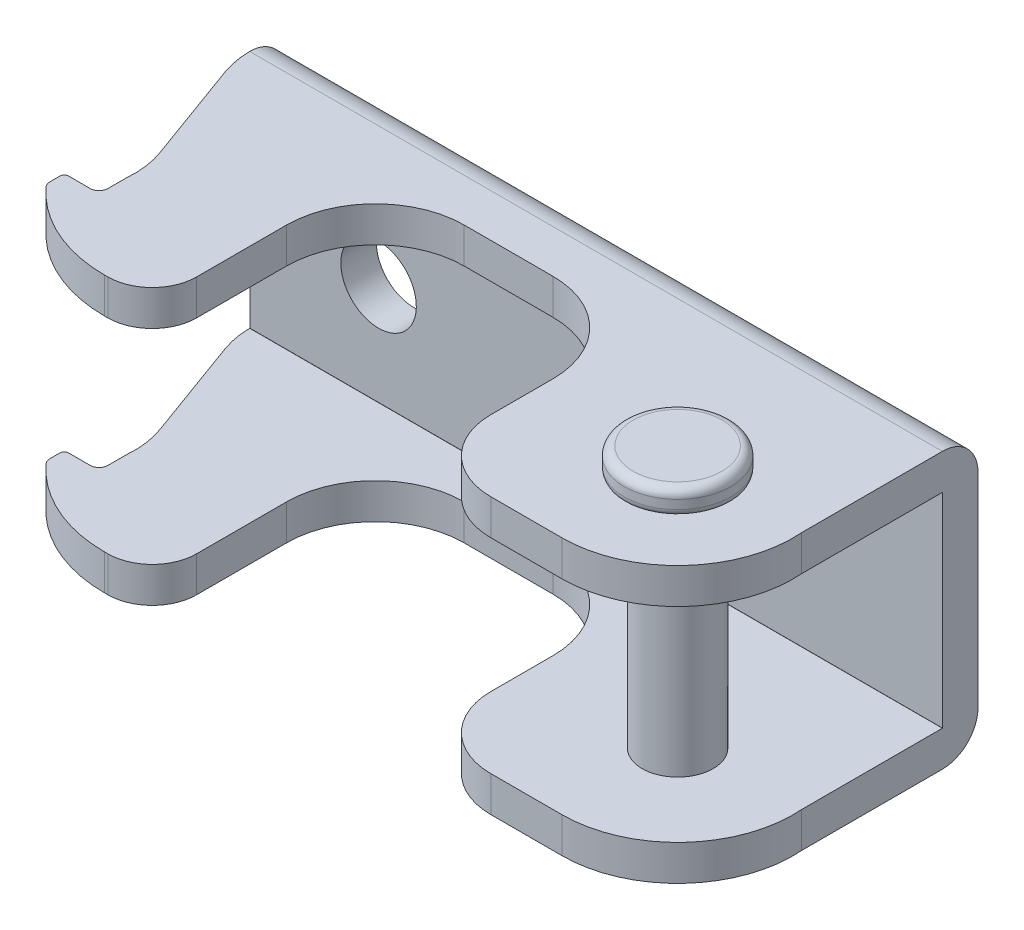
ISO-10303-21;
HEADER;
FILE_DESCRIPTION(('STEP AP214'),'2;1');
FILE_NAME('part.step','',(''),(''),'','','');
FILE_SCHEMA(('AUTOMOTIVE_DESIGN { 1 0 10303 214 1 1 1 1 }'));
ENDSEC;
DATA;
#1=APPLICATION_CONTEXT('core data for automotive mechanical design processes');
#2=APPLICATION_PROTOCOL_DEFINITION('international standard','automotive_design',2000,#1);
#3=PRODUCT_CONTEXT('',#1,'mechanical');
#4=PRODUCT('Part','Part','',(#3));
#5=PRODUCT_RELATED_PRODUCT_CATEGORY('part','',(#4));
#6=PRODUCT_DEFINITION_FORMATION('','',#4);
#7=PRODUCT_DEFINITION_CONTEXT('part definition',#1,'design');
#8=PRODUCT_DEFINITION('design','',#6,#7);
#9=PRODUCT_DEFINITION_SHAPE('','',#8);
#10=(LENGTH_UNIT() NAMED_UNIT(*) SI_UNIT(.MILLI.,.METRE.));
#11=(NAMED_UNIT(*) PLANE_ANGLE_UNIT() SI_UNIT($,.RADIAN.));
#12=(NAMED_UNIT(*) SI_UNIT($,.STERADIAN.) SOLID_ANGLE_UNIT());
#13=UNCERTAINTY_MEASURE_WITH_UNIT(LENGTH_MEASURE(1.E-05),#10,'distance_accuracy_value','');
#14=(GEOMETRIC_REPRESENTATION_CONTEXT(3) GLOBAL_UNCERTAINTY_ASSIGNED_CONTEXT((#13)) GLOBAL_UNIT_ASSIGNED_CONTEXT((#10,
#11,#12)) REPRESENTATION_CONTEXT('',''));
#15=CARTESIAN_POINT('',(0.,0.,0.));
#16=DIRECTION('',(0.,0.,1.));
#17=DIRECTION('',(1.,0.,0.));
#18=AXIS2_PLACEMENT_3D('',#15,#16,#17);
#19=CARTESIAN_POINT('',(-14.499981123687,-0.501337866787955,0.));
#20=DIRECTION('',(-0.999999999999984,1.80950715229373E-07,0.));
#21=DIRECTION('',(0.,0.,-1.));
#22=AXIS2_PLACEMENT_3D('',#19,#20,#21);
#23=PLANE('',#22);
#24=DIRECTION('',(1.80950718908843E-07,0.999999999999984,0.));
#25=VECTOR('',#24,1.);
#26=CARTESIAN_POINT('',(-14.499981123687,-0.501337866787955,0.));
#27=LINE('',#26,#25);
#28=CARTESIAN_POINT('',(-14.4999820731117,0.,0.));
#29=VERTEX_POINT('',#28);
#30=CARTESIAN_POINT('',(-14.4999789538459,11.4899999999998,0.));
#31=VERTEX_POINT('',#30);
#32=EDGE_CURVE('E418',#29,#31,#27,.T.);
#33=ORIENTED_EDGE('',*,*,#32,.F.);
#34=DIRECTION('',(1.80950718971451E-07,-0.999999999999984,0.));
#35=VECTOR('',#34,1.);
#36=CARTESIAN_POINT('',(-14.499981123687,0.501337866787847,0.));
#37=LINE('',#36,#35);
#38=CARTESIAN_POINT('',(-14.4999789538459,-11.49,0.));
#39=VERTEX_POINT('',#38);
#40=EDGE_CURVE('E422',#29,#39,#37,.T.);
#41=ORIENTED_EDGE('',*,*,#40,.T.);
#42=DIRECTION('',(0.,0.,1.));
#43=VECTOR('',#42,1.);
#44=CARTESIAN_POINT('',(-14.4999789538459,-11.49,0.));
#45=LINE('',#44,#43);
#46=CARTESIAN_POINT('',(-14.4999789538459,-11.49,4.));
#47=VERTEX_POINT('',#46);
#48=EDGE_CURVE('E1484',#39,#47,#45,.T.);
#49=ORIENTED_EDGE('',*,*,#48,.T.);
#50=DIRECTION('',(1.80950715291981E-07,-0.999999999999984,0.));
#51=VECTOR('',#50,1.);
#52=CARTESIAN_POINT('',(-14.4999811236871,0.501337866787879,4.));
#53=LINE('',#52,#51);
#54=CARTESIAN_POINT('',(-14.4999810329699,0.,3.99999999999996));
#55=VERTEX_POINT('',#54);
#56=EDGE_CURVE('E1479',#55,#47,#53,.T.);
#57=ORIENTED_EDGE('',*,*,#56,.F.);
#58=DIRECTION('',(1.80950715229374E-07,0.999999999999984,0.));
#59=VECTOR('',#58,1.);
#60=CARTESIAN_POINT('',(-14.4999811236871,-0.50133786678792,4.));
#61=LINE('',#60,#59);
#62=CARTESIAN_POINT('',(-14.4999789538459,11.49,3.99999999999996));
#63=VERTEX_POINT('',#62);
#64=EDGE_CURVE('E437',#55,#63,#61,.T.);
#65=ORIENTED_EDGE('',*,*,#64,.T.);
#66=CARTESIAN_POINT('',(-14.4998825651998,11.4999988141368,4.00984600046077));
#67=CARTESIAN_POINT('',(-14.4998835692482,11.4999963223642,4.00968399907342));
#68=CARTESIAN_POINT('',(-14.4998845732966,11.4999898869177,4.00952205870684));
#69=CARTESIAN_POINT('',(-14.4998865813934,11.4999691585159,4.00919868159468));
#70=CARTESIAN_POINT('',(-14.4998875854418,11.4999548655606,4.00903724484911));
#71=CARTESIAN_POINT('',(-14.4998895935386,11.4999184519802,4.00871525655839));
#72=CARTESIAN_POINT('',(-14.499890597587,11.499896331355,4.00855470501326));
#73=CARTESIAN_POINT('',(-14.4998926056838,11.4998443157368,4.0082348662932));
#74=CARTESIAN_POINT('',(-14.4998936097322,11.4998144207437,4.00807557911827));
#75=CARTESIAN_POINT('',(-14.499895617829,11.4997469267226,4.00775864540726));
#76=CARTESIAN_POINT('',(-14.4998966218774,11.4997093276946,4.00760099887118));
#77=CARTESIAN_POINT('',(-14.4998986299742,11.4996265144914,4.00728771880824));
#78=CARTESIAN_POINT('',(-14.4998996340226,11.4995813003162,4.00713208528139));
#79=CARTESIAN_POINT('',(-14.4999016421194,11.4994833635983,4.00682319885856));
#80=CARTESIAN_POINT('',(-14.4999026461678,11.4994306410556,4.00666994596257));
#81=CARTESIAN_POINT('',(-14.4999046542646,11.4993178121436,4.00636618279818));
#82=CARTESIAN_POINT('',(-14.499905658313,11.4992577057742,4.00621567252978));
#83=CARTESIAN_POINT('',(-14.4999076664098,11.499130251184,4.00591775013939));
#84=CARTESIAN_POINT('',(-14.4999086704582,11.4990629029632,4.0057703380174));
#85=CARTESIAN_POINT('',(-14.499910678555,11.4989211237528,4.00547896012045));
#86=CARTESIAN_POINT('',(-14.4999116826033,11.4988466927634,4.00533499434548));
#87=CARTESIAN_POINT('',(-14.4999136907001,11.4986909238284,4.00505084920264));
#88=CARTESIAN_POINT('',(-14.4999146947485,11.4986095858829,4.00491066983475));
#89=CARTESIAN_POINT('',(-14.4999167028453,11.4984401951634,4.0046344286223));
#90=CARTESIAN_POINT('',(-14.4999177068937,11.4983521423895,4.00449836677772));
#91=CARTESIAN_POINT('',(-14.4999197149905,11.4981695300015,4.00423068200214));
#92=CARTESIAN_POINT('',(-14.4999207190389,11.4980749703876,4.00409905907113));
#93=CARTESIAN_POINT('',(-14.4999227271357,11.497879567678,4.00384056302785));
#94=CARTESIAN_POINT('',(-14.4999237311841,11.4977787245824,4.00371368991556));
#95=CARTESIAN_POINT('',(-14.4999257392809,11.4975709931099,4.00346499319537));
#96=CARTESIAN_POINT('',(-14.4999267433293,11.497464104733,4.00334316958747));
#97=CARTESIAN_POINT('',(-14.4999287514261,11.4972445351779,4.0031048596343));
#98=CARTESIAN_POINT('',(-14.4999297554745,11.4971318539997,4.00298837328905));
#99=CARTESIAN_POINT('',(-14.4999317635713,11.4969009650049,4.00276101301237));
#100=CARTESIAN_POINT('',(-14.4999327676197,11.4967827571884,4.00265013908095));
#101=CARTESIAN_POINT('',(-14.4999347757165,11.4965410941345,4.00243426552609));
#102=CARTESIAN_POINT('',(-14.4999357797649,11.4964176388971,4.00232926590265));
#103=CARTESIAN_POINT('',(-14.4999377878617,11.4961657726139,4.00212538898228));
#104=CARTESIAN_POINT('',(-14.4999387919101,11.496037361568,4.00202651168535));
#105=CARTESIAN_POINT('',(-14.4999408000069,11.4957758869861,4.00183511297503));
#106=CARTESIAN_POINT('',(-14.4999418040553,11.49564282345,4.00174259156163));
#107=CARTESIAN_POINT('',(-14.4999438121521,11.4953723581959,4.00156412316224));
#108=CARTESIAN_POINT('',(-14.4999448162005,11.4952349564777,4.00147817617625));
#109=CARTESIAN_POINT('',(-14.4999468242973,11.4949561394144,4.00131305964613));
#110=CARTESIAN_POINT('',(-14.4999478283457,11.4948147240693,4.00123389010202));
#111=CARTESIAN_POINT('',(-14.4999498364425,11.4945282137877,4.00108251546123));
#112=CARTESIAN_POINT('',(-14.4999508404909,11.4943831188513,4.00101031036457));
#113=CARTESIAN_POINT('',(-14.4999528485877,11.4940895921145,4.0008730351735));
#114=CARTESIAN_POINT('',(-14.499953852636,11.4939411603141,4.0008079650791));
#115=CARTESIAN_POINT('',(-14.4999558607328,11.4936413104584,4.00068511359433));
#116=CARTESIAN_POINT('',(-14.4999568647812,11.4934898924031,4.00062733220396));
#117=CARTESIAN_POINT('',(-14.499958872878,11.4931844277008,4.00051919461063));
#118=CARTESIAN_POINT('',(-14.4999598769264,11.4930303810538,4.00046883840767));
#119=CARTESIAN_POINT('',(-14.4999618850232,11.4927200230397,4.00037567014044));
#120=CARTESIAN_POINT('',(-14.4999628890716,11.4925637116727,4.00033285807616));
#121=CARTESIAN_POINT('',(-14.4999648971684,11.492249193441,4.000254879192));
#122=CARTESIAN_POINT('',(-14.4999659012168,11.4920909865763,4.00021971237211));
#123=CARTESIAN_POINT('',(-14.4999679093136,11.4917730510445,4.00015710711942));
#124=CARTESIAN_POINT('',(-14.499968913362,11.4916133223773,4.00012966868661));
#125=CARTESIAN_POINT('',(-14.4999709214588,11.4912927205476,4.00008258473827));
#126=CARTESIAN_POINT('',(-14.4999719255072,11.4911318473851,4.00006293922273));
#127=CARTESIAN_POINT('',(-14.499973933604,11.4908093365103,4.00003148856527));
#128=CARTESIAN_POINT('',(-14.4999749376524,11.4906476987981,4.00001968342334));
#129=CARTESIAN_POINT('',(-14.4999769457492,11.4903240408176,4.00000393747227));
#130=CARTESIAN_POINT('',(-14.4999779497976,11.4901620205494,3.99999999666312));
#131=CARTESIAN_POINT('',(-14.499978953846,11.49,3.99999999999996));
#132=B_SPLINE_CURVE_WITH_KNOTS('',3,(#66,#67,#68,#69,#70,#71,#72,#73,#74,#75,#76,#77,#78,#79,
#80,#81,#82,#83,#84,#85,#86,#87,#88,#89,#90,#91,#92,#93,#94,#95,#96,#97,#98,#99,#100,#101,#102,
#103,#104,#105,#106,#107,#108,#109,#110,#111,#112,#113,#114,#115,#116,#117,#118,#119,#120,#121,
#122,#123,#124,#125,#126,#127,#128,#129,#130,#131),.UNSPECIFIED.,.F.,.F.,(4,2,2,2,2,2,2,2,2,2,2,
2,2,2,2,2,2,2,2,2,2,2,2,2,2,2,2,2,2,2,2,2,4),(0.,0.000486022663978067,0.000972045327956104,
0.00145806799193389,0.00194409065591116,0.00243011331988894,0.00291613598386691,
0.00340215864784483,0.00388818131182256,0.00437420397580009,0.00486022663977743,
0.00534624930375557,0.00583227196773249,0.00631829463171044,0.00680431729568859,
0.00729033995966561,0.00777636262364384,0.00826238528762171,0.00874840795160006,
0.009234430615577,0.00972045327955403,0.0102064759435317,0.0106924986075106,0.0111785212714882,
0.011664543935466,0.0121505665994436,0.0126365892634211,0.0131226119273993,0.0136086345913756,
0.0140946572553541,0.0145806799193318,0.0150667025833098,0.0155527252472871),.UNSPECIFIED.);
#133=CARTESIAN_POINT('',(-14.4998825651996,11.4999976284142,4.00984601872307));
#134=VERTEX_POINT('',#133);
#135=EDGE_CURVE('E325',#134,#63,#132,.T.);
#136=ORIENTED_EDGE('',*,*,#135,.F.);
#137=CARTESIAN_POINT('',(-14.4999783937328,15.4980979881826,3.88650701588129));
#138=CARTESIAN_POINT('',(-14.4999783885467,15.4115109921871,3.88917817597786));
#139=CARTESIAN_POINT('',(-14.4999783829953,15.3249239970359,3.89184936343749));
#140=CARTESIAN_POINT('',(-14.4999783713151,15.156183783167,3.89705498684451));
#141=CARTESIAN_POINT('',(-14.4999783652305,15.0740305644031,3.89958942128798));
#142=CARTESIAN_POINT('',(-14.4999783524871,14.9141579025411,3.90452151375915));
#143=CARTESIAN_POINT('',(-14.4999783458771,14.8364384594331,3.90691917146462));
#144=CARTESIAN_POINT('',(-14.4999783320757,14.6854333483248,3.91157769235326));
#145=CARTESIAN_POINT('',(-14.4999783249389,14.6121476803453,3.91383855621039));
#146=CARTESIAN_POINT('',(-14.4999783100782,14.4700101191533,3.9182234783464));
#147=CARTESIAN_POINT('',(-14.4999783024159,14.4011582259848,3.92034753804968));
#148=CARTESIAN_POINT('',(-14.4999782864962,14.267888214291,3.92445884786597));
#149=CARTESIAN_POINT('',(-14.499978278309,14.2034700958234,3.92644609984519));
#150=CARTESIAN_POINT('',(-14.4999782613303,14.0790676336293,3.930283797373));
#151=CARTESIAN_POINT('',(-14.4999782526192,14.0190832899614,3.93213424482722));
#152=CARTESIAN_POINT('',(-14.4999782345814,13.9035483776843,3.93569834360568));
#153=CARTESIAN_POINT('',(-14.4999782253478,13.847997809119,3.93741199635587));
#154=CARTESIAN_POINT('',(-14.4999782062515,13.7413304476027,3.94070252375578));
#155=CARTESIAN_POINT('',(-14.4999781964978,13.6902136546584,3.94227939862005));
#156=CARTESIAN_POINT('',(-14.4999781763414,13.5924138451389,3.94529639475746));
#157=CARTESIAN_POINT('',(-14.4999781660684,13.5457308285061,3.94673651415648));
#158=CARTESIAN_POINT('',(-14.4999781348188,13.414711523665,3.95077840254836));
#159=CARTESIAN_POINT('',(-14.4999781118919,13.3303752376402,3.95338024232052));
#160=CARTESIAN_POINT('',(-14.4999780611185,13.1705533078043,3.95831089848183));
#161=CARTESIAN_POINT('',(-14.4999780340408,13.0950676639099,3.96063971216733));
#162=CARTESIAN_POINT('',(-14.4999779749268,12.9529470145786,3.96502419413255));
#163=CARTESIAN_POINT('',(-14.4999779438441,12.8863120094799,3.96707987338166));
#164=CARTESIAN_POINT('',(-14.4999778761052,12.7618926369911,3.9709180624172));
#165=CARTESIAN_POINT('',(-14.4999778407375,12.7041082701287,3.9727005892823));
#166=CARTESIAN_POINT('',(-14.4999777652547,12.5973901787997,3.97599262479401));
#167=CARTESIAN_POINT('',(-14.4999777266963,12.5484564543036,3.97750213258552));
#168=CARTESIAN_POINT('',(-14.4999776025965,12.4196650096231,3.98147526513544));
#169=CARTESIAN_POINT('',(-14.4999775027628,12.3398072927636,3.98393899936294));
#170=CARTESIAN_POINT('',(-14.4999772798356,12.1977221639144,3.98832311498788));
#171=CARTESIAN_POINT('',(-14.4999771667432,12.1354947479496,3.99024337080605));
#172=CARTESIAN_POINT('',(-14.4999769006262,12.0487649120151,3.99291755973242));
#173=CARTESIAN_POINT('',(-14.4999768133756,12.0242625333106,3.99367281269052));
#174=CARTESIAN_POINT('',(-14.4999766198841,11.9616685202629,3.9956062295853));
#175=CARTESIAN_POINT('',(-14.4999765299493,11.9235769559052,3.99678663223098));
#176=CARTESIAN_POINT('',(-14.4999758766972,11.8521819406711,3.9989774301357));
#177=CARTESIAN_POINT('',(-14.4999753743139,11.8188785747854,3.99999054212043));
#178=CARTESIAN_POINT('',(-14.4999753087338,11.7388398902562,4.00250775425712));
#179=CARTESIAN_POINT('',(-14.4999762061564,11.6921056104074,4.00404505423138));
#180=CARTESIAN_POINT('',(-14.4999548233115,11.5969158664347,4.0070694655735));
#181=CARTESIAN_POINT('',(-14.4999316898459,11.5484602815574,4.00855265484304));
#182=CARTESIAN_POINT('',(-14.4998825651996,11.4999988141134,4.00984600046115));
#183=B_SPLINE_CURVE_WITH_KNOTS('',3,(#137,#138,#139,#140,#141,#142,#143,#144,#145,#146,#147,
#148,#149,#150,#151,#152,#153,#154,#155,#156,#157,#158,#159,#160,#161,#162,#163,#164,#165,#166,
#167,#168,#169,#170,#171,#172,#173,#174,#175,#176,#177,#178,#179,#180,#181,#182),.UNSPECIFIED.,
.F.,.F.,(4,2,2,2,2,2,2,2,2,2,2,2,2,2,2,2,2,2,2,2,2,2,4),(0.,0.259884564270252,0.506461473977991,
0.739730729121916,0.959692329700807,1.16634627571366,1.35969256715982,1.53973120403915,
1.70646218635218,1.85988551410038,2.00000118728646,2.2531304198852,2.47969509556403,
2.67969521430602,2.85313077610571,3.00000178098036,3.2396889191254,3.42646003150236,
3.50000207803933,3.61433163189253,3.71428792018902,3.85456642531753,4.00000140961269),.UNSPECIFIED.);
#184=CARTESIAN_POINT('',(-14.4999783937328,15.4980979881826,3.88650701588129));
#185=VERTEX_POINT('',#184);
#186=EDGE_CURVE('E515',#134,#185,#183,.F.);
#187=ORIENTED_EDGE('',*,*,#186,.T.);
#188=CARTESIAN_POINT('',(-14.4999782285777,15.4980979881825,3.88650701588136));
#189=CARTESIAN_POINT('',(-14.49997823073,15.4862034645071,3.50045742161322));
#190=CARTESIAN_POINT('',(-14.4999782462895,15.4002159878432,3.12203857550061));
#191=CARTESIAN_POINT('',(-14.4999782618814,15.3140494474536,2.74283169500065));
#192=CARTESIAN_POINT('',(-14.4999782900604,15.1583219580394,2.3902734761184));
#193=CARTESIAN_POINT('',(-14.4999783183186,15.0021568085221,2.03672441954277));
#194=CARTESIAN_POINT('',(-14.499978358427,14.7805027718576,1.71852535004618));
#195=CARTESIAN_POINT('',(-14.4999783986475,14.5582295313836,1.39943737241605));
#196=CARTESIAN_POINT('',(-14.4999784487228,14.2814953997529,1.13117151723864));
#197=CARTESIAN_POINT('',(-14.4999784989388,14.0039835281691,0.862151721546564));
#198=CARTESIAN_POINT('',(-14.4999785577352,13.6790526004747,0.650489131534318));
#199=CARTESIAN_POINT('',(-14.499978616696,13.3532139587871,0.438235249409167));
#200=CARTESIAN_POINT('',(-14.4999786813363,12.9959876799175,0.293536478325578));
#201=CARTESIAN_POINT('',(-14.4999787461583,12.6377574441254,0.148431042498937));
#202=CARTESIAN_POINT('',(-14.4999788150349,12.2571202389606,0.0742928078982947));
#203=CARTESIAN_POINT('',(-14.4999788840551,11.8756894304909,0.));
#204=CARTESIAN_POINT('',(-14.4999789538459,11.4899999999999,0.));
#205=B_SPLINE_CURVE_WITH_KNOTS('',2,(#188,#189,#190,#191,#192,#193,#194,#195,#196,#197,#198,
#199,#200,#201,#202,#203,#204),.UNSPECIFIED.,.F.,.F.,(3,2,2,2,2,2,2,2,3),(0.,0.125,0.25,0.375,
0.5,0.625,0.75,0.875,1.),.UNSPECIFIED.);
#206=EDGE_CURVE('E425',#185,#31,#205,.T.);
#207=ORIENTED_EDGE('',*,*,#206,.T.);
#208=EDGE_LOOP('',(#33,#41,#49,#57,#65,#136,#187,#207));
#209=FACE_BOUND('',#208,.T.);
#210=ADVANCED_FACE('F14',(#209),#23,.T.);
#211=CARTESIAN_POINT('',(0.,0.,-0.00343069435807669));
#212=DIRECTION('',(0.,0.,1.));
#213=DIRECTION('',(0.,1.,0.));
#214=AXIS2_PLACEMENT_3D('',#211,#212,#213);
#215=CYLINDRICAL_SURFACE('',#214,4.25);
#216=CARTESIAN_POINT('',(0.,0.,4.));
#217=DIRECTION('',(0.,0.,1.));
#218=DIRECTION('',(0.,1.,0.));
#219=AXIS2_PLACEMENT_3D('',#216,#217,#218);
#220=CIRCLE('',#219,4.25);
#221=CARTESIAN_POINT('',(0.,4.24999999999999,4.));
#222=VERTEX_POINT('',#221);
#223=EDGE_CURVE('E2120',#222,#222,#220,.T.);
#224=ORIENTED_EDGE('',*,*,#223,.T.);
#225=EDGE_LOOP('',(#224));
#226=FACE_BOUND('',#225,.T.);
#227=CARTESIAN_POINT('',(0.,0.,0.));
#228=DIRECTION('',(0.,0.,1.));
#229=DIRECTION('',(0.,1.,0.));
#230=AXIS2_PLACEMENT_3D('',#227,#228,#229);
#231=CIRCLE('',#230,4.25);
#232=CARTESIAN_POINT('',(0.,4.25,0.));
#233=VERTEX_POINT('',#232);
#234=EDGE_CURVE('E2328',#233,#233,#231,.T.);
#235=ORIENTED_EDGE('',*,*,#234,.F.);
#236=EDGE_LOOP('',(#235));
#237=FACE_BOUND('',#236,.T.);
#238=ADVANCED_FACE('F405',(#226,#237),#215,.F.);
#239=CARTESIAN_POINT('',(38.,0.,-0.00343069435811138));
#240=DIRECTION('',(0.,0.,1.));
#241=DIRECTION('',(0.,1.,0.));
#242=AXIS2_PLACEMENT_3D('',#239,#240,#241);
#243=CYLINDRICAL_SURFACE('',#242,4.25);
#244=CARTESIAN_POINT('',(38.,0.,3.99999999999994));
#245=DIRECTION('',(0.,0.,1.));
#246=DIRECTION('',(0.,1.,0.));
#247=AXIS2_PLACEMENT_3D('',#244,#245,#246);
#248=CIRCLE('',#247,4.25);
#249=CARTESIAN_POINT('',(38.,4.24999999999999,3.99999999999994));
#250=VERTEX_POINT('',#249);
#251=EDGE_CURVE('E2324',#250,#250,#248,.T.);
#252=ORIENTED_EDGE('',*,*,#251,.T.);
#253=EDGE_LOOP('',(#252));
#254=FACE_BOUND('',#253,.T.);
#255=CARTESIAN_POINT('',(38.,0.,0.));
#256=DIRECTION('',(0.,0.,1.));
#257=DIRECTION('',(0.,1.,0.));
#258=AXIS2_PLACEMENT_3D('',#255,#256,#257);
#259=CIRCLE('',#258,4.25);
#260=CARTESIAN_POINT('',(38.,4.24999999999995,0.));
#261=VERTEX_POINT('',#260);
#262=EDGE_CURVE('E2333',#261,#261,#259,.T.);
#263=ORIENTED_EDGE('',*,*,#262,.F.);
#264=EDGE_LOOP('',(#263));
#265=FACE_BOUND('',#264,.T.);
#266=ADVANCED_FACE('F411',(#254,#265),#243,.F.);
#267=CARTESIAN_POINT('',(63.5,-31.5013491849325,0.));
#268=DIRECTION('',(1.,0.,0.));
#269=DIRECTION('',(0.,-1.,0.));
#270=AXIS2_PLACEMENT_3D('',#267,#268,#269);
#271=PLANE('',#270);
#272=DIRECTION('',(0.,-1.,0.));
#273=VECTOR('',#272,1.);
#274=CARTESIAN_POINT('',(63.5,-31.5013491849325,4.));
#275=LINE('',#274,#273);
#276=CARTESIAN_POINT('',(63.5,11.49,4.));
#277=VERTEX_POINT('',#276);
#278=CARTESIAN_POINT('',(63.5,-11.49,4.));
#279=VERTEX_POINT('',#278);
#280=EDGE_CURVE('E588',#277,#279,#275,.T.);
#281=ORIENTED_EDGE('',*,*,#280,.T.);
#282=CARTESIAN_POINT('',(63.5,-11.49,4.01));
#283=DIRECTION('',(-1.,0.,0.));
#284=DIRECTION('',(0.,-1.,0.));
#285=AXIS2_PLACEMENT_3D('',#282,#283,#284);
#286=CIRCLE('',#285,0.0100000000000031);
#287=CARTESIAN_POINT('',(63.5,-11.5,4.01));
#288=VERTEX_POINT('',#287);
#289=EDGE_CURVE('E1144',#279,#288,#286,.T.);
#290=ORIENTED_EDGE('',*,*,#289,.T.);
#291=DIRECTION('',(0.,0.,-1.));
#292=VECTOR('',#291,1.);
#293=CARTESIAN_POINT('',(63.5,-11.5000000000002,-42.1386498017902));
#294=LINE('',#293,#292);
#295=CARTESIAN_POINT('',(63.5,-11.5,19.8613491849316));
#296=VERTEX_POINT('',#295);
#297=EDGE_CURVE('E1119',#296,#288,#294,.T.);
#298=ORIENTED_EDGE('',*,*,#297,.F.);
#299=DIRECTION('',(0.,1.,0.));
#300=VECTOR('',#299,1.);
#301=CARTESIAN_POINT('',(63.5,-15.5,19.8613491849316));
#302=LINE('',#301,#300);
#303=CARTESIAN_POINT('',(63.5,-15.5,19.8613491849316));
#304=VERTEX_POINT('',#303);
#305=EDGE_CURVE('E1134',#304,#296,#302,.T.);
#306=ORIENTED_EDGE('',*,*,#305,.F.);
#307=DIRECTION('',(0.,0.,-1.));
#308=VECTOR('',#307,1.);
#309=CARTESIAN_POINT('',(63.5,-15.5,19.8613491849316));
#310=LINE('',#309,#308);
#311=CARTESIAN_POINT('',(63.5,-15.5,4.00999999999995));
#312=VERTEX_POINT('',#311);
#313=EDGE_CURVE('E984',#304,#312,#310,.T.);
#314=ORIENTED_EDGE('',*,*,#313,.T.);
#315=CARTESIAN_POINT('',(63.5,-11.49,4.01));
#316=DIRECTION('',(-1.,0.,0.));
#317=DIRECTION('',(0.,1.,0.));
#318=AXIS2_PLACEMENT_3D('',#315,#316,#317);
#319=CIRCLE('',#318,4.01);
#320=CARTESIAN_POINT('',(63.5,-11.4900000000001,0.));
#321=VERTEX_POINT('',#320);
#322=EDGE_CURVE('E1158',#321,#312,#319,.T.);
#323=ORIENTED_EDGE('',*,*,#322,.F.);
#324=DIRECTION('',(0.,-1.,0.));
#325=VECTOR('',#324,1.);
#326=CARTESIAN_POINT('',(63.5,30.4986498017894,0.));
#327=LINE('',#326,#325);
#328=CARTESIAN_POINT('',(63.5,11.49,0.));
#329=VERTEX_POINT('',#328);
#330=EDGE_CURVE('E431',#329,#321,#327,.T.);
#331=ORIENTED_EDGE('',*,*,#330,.F.);
#332=CARTESIAN_POINT('',(63.5,11.49,4.01));
#333=DIRECTION('',(1.,0.,0.));
#334=DIRECTION('',(0.,-1.,0.));
#335=AXIS2_PLACEMENT_3D('',#332,#333,#334);
#336=CIRCLE('',#335,4.01);
#337=CARTESIAN_POINT('',(63.5,15.5,4.01));
#338=VERTEX_POINT('',#337);
#339=EDGE_CURVE('E40',#329,#338,#336,.T.);
#340=ORIENTED_EDGE('',*,*,#339,.T.);
#341=DIRECTION('',(0.,0.,-1.));
#342=VECTOR('',#341,1.);
#343=CARTESIAN_POINT('',(63.5,15.5,19.8613491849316));
#344=LINE('',#343,#342);
#345=CARTESIAN_POINT('',(63.5,15.5,19.8613491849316));
#346=VERTEX_POINT('',#345);
#347=EDGE_CURVE('E316',#346,#338,#344,.T.);
#348=ORIENTED_EDGE('',*,*,#347,.F.);
#349=DIRECTION('',(0.,-1.,0.));
#350=VECTOR('',#349,1.);
#351=CARTESIAN_POINT('',(63.5,15.5,19.8613491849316));
#352=LINE('',#351,#350);
#353=CARTESIAN_POINT('',(63.5,11.5,19.8613491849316));
#354=VERTEX_POINT('',#353);
#355=EDGE_CURVE('E244',#346,#354,#352,.T.);
#356=ORIENTED_EDGE('',*,*,#355,.T.);
#357=DIRECTION('',(0.,0.,-1.));
#358=VECTOR('',#357,1.);
#359=CARTESIAN_POINT('',(63.5,11.5000000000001,-42.1386498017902));
#360=LINE('',#359,#358);
#361=CARTESIAN_POINT('',(63.5,11.5,4.01));
#362=VERTEX_POINT('',#361);
#363=EDGE_CURVE('E521',#354,#362,#360,.T.);
#364=ORIENTED_EDGE('',*,*,#363,.T.);
#365=CARTESIAN_POINT('',(63.5,11.49,4.01));
#366=DIRECTION('',(1.,0.,0.));
#367=DIRECTION('',(0.,1.,0.));
#368=AXIS2_PLACEMENT_3D('',#365,#366,#367);
#369=CIRCLE('',#368,0.0100000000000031);
#370=EDGE_CURVE('E605',#277,#362,#369,.T.);
#371=ORIENTED_EDGE('',*,*,#370,.F.);
#372=EDGE_LOOP('',(#281,#290,#298,#306,#314,#323,#331,#340,#348,#356,#364,#371));
#373=FACE_BOUND('',#372,.T.);
#374=ADVANCED_FACE('F493',(#373),#271,.T.);
#375=CARTESIAN_POINT('',(-14.4997867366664,15.5,4.01));
#376=CARTESIAN_POINT('',(-14.4998506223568,15.5,3.96882916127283));
#377=CARTESIAN_POINT('',(-14.4999145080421,15.4993658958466,3.92765832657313));
#378=CARTESIAN_POINT('',(-14.4999783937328,15.4980979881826,3.88650701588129));
#379=CARTESIAN_POINT('',(-14.4997867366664,11.5,4.01));
#380=CARTESIAN_POINT('',(-14.4998506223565,11.5,4.00989732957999));
#381=CARTESIAN_POINT('',(-14.4999145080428,11.4999984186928,4.00979465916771));
#382=CARTESIAN_POINT('',(-14.4999783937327,11.4999952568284,4.00969203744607));
#383=(BOUNDED_SURFACE() B_SPLINE_SURFACE(1,3,((#375,#376,#377,#378),(#379,#380,#381,#382)),
.UNSPECIFIED.,.F.,.F.,.F.) B_SPLINE_SURFACE_WITH_KNOTS((2,2),(4,4),(0.,1.),(0.,1.),
.UNSPECIFIED.) GEOMETRIC_REPRESENTATION_ITEM() RATIONAL_B_SPLINE_SURFACE(((1.,1.,1.,1.),(1.,1.,
1.,1.))) REPRESENTATION_ITEM('') SURFACE());
#384=CARTESIAN_POINT('',(-14.4998825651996,11.4999988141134,4.00984600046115));
#385=CARTESIAN_POINT('',(-14.4998364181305,11.5463665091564,4.00964049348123));
#386=CARTESIAN_POINT('',(-14.499813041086,11.5927341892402,4.00961459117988));
#387=CARTESIAN_POINT('',(-14.4997876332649,11.6927338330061,4.00969524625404));
#388=CARTESIAN_POINT('',(-14.4997895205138,11.7463657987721,4.00982319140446));
#389=CARTESIAN_POINT('',(-14.4997896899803,11.829241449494,4.00987365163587));
#390=CARTESIAN_POINT('',(-14.4997892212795,11.8584851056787,4.00986312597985));
#391=CARTESIAN_POINT('',(-14.4997885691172,11.9251518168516,4.00985479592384));
#392=CARTESIAN_POINT('',(-14.4997885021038,11.9625748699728,4.00986137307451));
#393=CARTESIAN_POINT('',(-14.4997883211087,12.0245237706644,4.00986615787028));
#394=CARTESIAN_POINT('',(-14.4997882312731,12.0490496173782,4.00986646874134));
#395=CARTESIAN_POINT('',(-14.4997879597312,12.13583841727,4.00986843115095));
#396=CARTESIAN_POINT('',(-14.4997878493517,12.1981013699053,4.00987140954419));
#397=CARTESIAN_POINT('',(-14.4997876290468,12.3402422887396,4.00987776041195));
#398=CARTESIAN_POINT('',(-14.4997875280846,12.4201202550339,4.00988100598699));
#399=CARTESIAN_POINT('',(-14.499787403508,12.5489670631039,4.00988595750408));
#400=CARTESIAN_POINT('',(-14.4997873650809,12.5979359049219,4.00988777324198));
#401=CARTESIAN_POINT('',(-14.4997872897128,12.7047225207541,4.00989172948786));
#402=CARTESIAN_POINT('',(-14.4997872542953,12.762540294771,4.00989386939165));
#403=CARTESIAN_POINT('',(-14.4997871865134,12.8870247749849,4.00989858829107));
#404=CARTESIAN_POINT('',(-14.499787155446,12.9536914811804,4.00990118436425));
#405=CARTESIAN_POINT('',(-14.4997870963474,13.095873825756,4.00990680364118));
#406=CARTESIAN_POINT('',(-14.4997870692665,13.1713894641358,4.00990983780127));
#407=CARTESIAN_POINT('',(-14.499787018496,13.3312696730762,4.00991623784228));
#408=CARTESIAN_POINT('',(-14.4997869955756,13.4156342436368,4.00991960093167));
#409=CARTESIAN_POINT('',(-14.4997869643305,13.5467093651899,4.00992466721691));
#410=CARTESIAN_POINT('',(-14.4997869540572,13.5934199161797,4.0099264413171));
#411=CARTESIAN_POINT('',(-14.4997869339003,13.6912757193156,4.00993013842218));
#412=CARTESIAN_POINT('',(-14.4997869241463,13.7424209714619,4.00993205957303));
#413=CARTESIAN_POINT('',(-14.4997869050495,13.849146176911,4.00993607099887));
#414=CARTESIAN_POINT('',(-14.4997868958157,13.9047261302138,4.00993816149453));
#415=CARTESIAN_POINT('',(-14.4997868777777,14.020320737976,4.00994252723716));
#416=CARTESIAN_POINT('',(-14.4997868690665,14.0803353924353,4.00994480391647));
#417=CARTESIAN_POINT('',(-14.4997868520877,14.2047994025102,4.00994955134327));
#418=CARTESIAN_POINT('',(-14.4997868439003,14.2692487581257,4.00995202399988));
#419=CARTESIAN_POINT('',(-14.4997868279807,14.4025821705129,4.00995716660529));
#420=CARTESIAN_POINT('',(-14.4997868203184,14.4714662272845,4.00995983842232));
#421=CARTESIAN_POINT('',(-14.4997868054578,14.6136690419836,4.00996537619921));
#422=CARTESIAN_POINT('',(-14.4997867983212,14.6869877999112,4.00996824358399));
#423=CARTESIAN_POINT('',(-14.49978678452,14.8380600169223,4.00997416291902));
#424=CARTESIAN_POINT('',(-14.4997867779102,14.9158134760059,4.00997721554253));
#425=CARTESIAN_POINT('',(-14.4997867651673,15.0757550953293,4.00998348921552));
#426=CARTESIAN_POINT('',(-14.4997867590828,15.1579432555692,4.00998670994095));
#427=CARTESIAN_POINT('',(-14.4997867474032,15.3267542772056,4.00999329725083));
#428=CARTESIAN_POINT('',(-14.4997867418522,15.4133771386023,4.00999666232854));
#429=CARTESIAN_POINT('',(-14.4997867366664,15.5,4.01));
#430=B_SPLINE_CURVE_WITH_KNOTS('',3,(#384,#385,#386,#387,#388,#389,#390,#391,#392,#393,#394,
#395,#396,#397,#398,#399,#400,#401,#402,#403,#404,#405,#406,#407,#408,#409,#410,#411,#412,#413,
#414,#415,#416,#417,#418,#419,#420,#421,#422,#423,#424,#425,#426,#427,#428,#429),.UNSPECIFIED.,
.F.,.F.,(4,2,2,2,2,2,2,2,2,2,2,2,2,2,2,2,2,2,2,2,2,2,4),(0.,0.139103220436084,0.29999927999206,
0.38773023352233,0.499999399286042,0.57357693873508,0.760365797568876,0.999999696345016,
1.14690622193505,1.32035954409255,1.52035966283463,1.74690657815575,2.00000029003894,
2.14013194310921,2.29356769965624,2.46030755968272,2.64035152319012,2.83369959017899,
3.04035176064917,3.26030803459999,3.49356841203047,3.74013289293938,4.00000147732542),.UNSPECIFIED.);
#431=CARTESIAN_POINT('',(-14.4997867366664,15.5,4.01000000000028));
#432=VERTEX_POINT('',#431);
#433=EDGE_CURVE('E609',#432,#134,#430,.F.);
#434=CARTESIAN_POINT('',(-14.4997867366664,15.5,4.01000000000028));
#435=CARTESIAN_POINT('',(-14.4998506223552,15.5,3.96882916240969));
#436=CARTESIAN_POINT('',(-14.4999145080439,15.4993658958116,3.92765832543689));
#437=CARTESIAN_POINT('',(-14.4999783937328,15.4980979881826,3.88650701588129));
#438=(BOUNDED_CURVE() B_SPLINE_CURVE(3,(#434,#435,#436,#437),.UNSPECIFIED.,.F.,
.F.) B_SPLINE_CURVE_WITH_KNOTS((4,4),(0.,1.),
.UNSPECIFIED.) CURVE() GEOMETRIC_REPRESENTATION_ITEM() RATIONAL_B_SPLINE_CURVE((1.,1.,1.,1.)) REPRESENTATION_ITEM(''));
#439=EDGE_CURVE('E128',#432,#185,#438,.T.);
#440=ORIENTED_EDGE('',*,*,#433,.F.);
#441=ORIENTED_EDGE('',*,*,#439,.T.);
#442=ORIENTED_EDGE('',*,*,#186,.F.);
#443=EDGE_LOOP('',(#440,#441,#442));
#444=FACE_BOUND('',#443,.T.);
#445=ADVANCED_FACE('F486',(#444),#383,.F.);
#446=CARTESIAN_POINT('',(50.5385185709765,31.4986493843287,0.));
#447=DIRECTION('',(0.,0.,1.));
#448=DIRECTION('',(-1.,0.,0.));
#449=AXIS2_PLACEMENT_3D('',#446,#447,#448);
#450=PLANE('',#449);
#451=ORIENTED_EDGE('',*,*,#262,.T.);
#452=EDGE_LOOP('',(#451));
#453=FACE_BOUND('',#452,.T.);
#454=ORIENTED_EDGE('',*,*,#234,.T.);
#455=EDGE_LOOP('',(#454));
#456=FACE_BOUND('',#455,.T.);
#457=ORIENTED_EDGE('',*,*,#32,.T.);
#458=DIRECTION('',(1.,0.,0.));
#459=VECTOR('',#458,1.);
#460=CARTESIAN_POINT('',(50.5385185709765,11.49,0.));
#461=LINE('',#460,#459);
#462=EDGE_CURVE('E446',#31,#329,#461,.T.);
#463=ORIENTED_EDGE('',*,*,#462,.T.);
#464=ORIENTED_EDGE('',*,*,#330,.T.);
#465=DIRECTION('',(1.,0.,0.));
#466=VECTOR('',#465,1.);
#467=CARTESIAN_POINT('',(50.5385185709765,-11.49,0.));
#468=LINE('',#467,#466);
#469=EDGE_CURVE('E1222',#39,#321,#468,.T.);
#470=ORIENTED_EDGE('',*,*,#469,.F.);
#471=ORIENTED_EDGE('',*,*,#40,.F.);
#472=EDGE_LOOP('',(#457,#463,#464,#470,#471));
#473=FACE_BOUND('',#472,.T.);
#474=ADVANCED_FACE('F492',(#453,#456,#473),#450,.F.);
#475=CARTESIAN_POINT('',(-14.4997867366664,-15.5,4.00999999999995));
#476=CARTESIAN_POINT('',(-14.4998506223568,-15.5,3.9688291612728));
#477=CARTESIAN_POINT('',(-14.4999145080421,-15.4993658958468,3.9276583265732));
#478=CARTESIAN_POINT('',(-14.4999783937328,-15.4980979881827,3.88650701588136));
#479=CARTESIAN_POINT('',(-14.4997867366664,-11.5,4.01));
#480=CARTESIAN_POINT('',(-14.4998506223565,-11.5,4.00989732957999));
#481=CARTESIAN_POINT('',(-14.4999145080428,-11.4999984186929,4.00979465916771));
#482=CARTESIAN_POINT('',(-14.4999783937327,-11.4999952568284,4.00969203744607));
#483=(BOUNDED_SURFACE() B_SPLINE_SURFACE(1,3,((#475,#476,#477,#478),(#479,#480,#481,#482)),
.UNSPECIFIED.,.F.,.F.,.F.) B_SPLINE_SURFACE_WITH_KNOTS((2,2),(4,4),(0.,1.),(0.,1.),
.UNSPECIFIED.) GEOMETRIC_REPRESENTATION_ITEM() RATIONAL_B_SPLINE_SURFACE(((1.,1.,1.,1.),(1.,1.,
1.,1.))) REPRESENTATION_ITEM('') SURFACE());
#484=CARTESIAN_POINT('',(-14.4997867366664,-15.5,4.00999999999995));
#485=CARTESIAN_POINT('',(-14.4997867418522,-15.4133771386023,4.00999666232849));
#486=CARTESIAN_POINT('',(-14.4997867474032,-15.3267542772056,4.00999329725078));
#487=CARTESIAN_POINT('',(-14.4997867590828,-15.1579432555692,4.0099867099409));
#488=CARTESIAN_POINT('',(-14.4997867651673,-15.0757550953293,4.00998348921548));
#489=CARTESIAN_POINT('',(-14.4997867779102,-14.9158134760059,4.00997721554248));
#490=CARTESIAN_POINT('',(-14.49978678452,-14.8380600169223,4.00997416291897));
#491=CARTESIAN_POINT('',(-14.4997867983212,-14.6869877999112,4.00996824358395));
#492=CARTESIAN_POINT('',(-14.4997868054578,-14.6136690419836,4.00996537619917));
#493=CARTESIAN_POINT('',(-14.4997868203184,-14.4714662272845,4.00995983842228));
#494=CARTESIAN_POINT('',(-14.4997868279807,-14.4025821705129,4.00995716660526));
#495=CARTESIAN_POINT('',(-14.4997868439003,-14.2692487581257,4.00995202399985));
#496=CARTESIAN_POINT('',(-14.4997868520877,-14.2047994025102,4.00994955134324));
#497=CARTESIAN_POINT('',(-14.4997868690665,-14.0803353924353,4.00994480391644));
#498=CARTESIAN_POINT('',(-14.4997868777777,-14.020320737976,4.00994252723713));
#499=CARTESIAN_POINT('',(-14.4997868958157,-13.9047261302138,4.0099381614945));
#500=CARTESIAN_POINT('',(-14.4997869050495,-13.849146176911,4.00993607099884));
#501=CARTESIAN_POINT('',(-14.4997869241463,-13.7424209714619,4.009932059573));
#502=CARTESIAN_POINT('',(-14.4997869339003,-13.6912757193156,4.00993013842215));
#503=CARTESIAN_POINT('',(-14.4997869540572,-13.5934199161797,4.00992644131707));
#504=CARTESIAN_POINT('',(-14.4997869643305,-13.5467093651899,4.00992466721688));
#505=CARTESIAN_POINT('',(-14.4997869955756,-13.4156342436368,4.00991960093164));
#506=CARTESIAN_POINT('',(-14.499787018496,-13.3312696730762,4.00991623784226));
#507=CARTESIAN_POINT('',(-14.4997870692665,-13.1713894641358,4.00990983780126));
#508=CARTESIAN_POINT('',(-14.4997870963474,-13.095873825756,4.00990680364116));
#509=CARTESIAN_POINT('',(-14.499787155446,-12.9536914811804,4.00990118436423));
#510=CARTESIAN_POINT('',(-14.4997871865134,-12.8870247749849,4.00989858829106));
#511=CARTESIAN_POINT('',(-14.4997872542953,-12.762540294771,4.00989386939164));
#512=CARTESIAN_POINT('',(-14.4997872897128,-12.7047225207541,4.00989172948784));
#513=CARTESIAN_POINT('',(-14.4997873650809,-12.5979359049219,4.00988777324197));
#514=CARTESIAN_POINT('',(-14.499787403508,-12.5489670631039,4.00988595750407));
#515=CARTESIAN_POINT('',(-14.4997875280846,-12.4201202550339,4.00988100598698));
#516=CARTESIAN_POINT('',(-14.4997876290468,-12.3402422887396,4.00987776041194));
#517=CARTESIAN_POINT('',(-14.4997878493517,-12.1981013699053,4.00987140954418));
#518=CARTESIAN_POINT('',(-14.4997879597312,-12.13583841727,4.00986843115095));
#519=CARTESIAN_POINT('',(-14.4997882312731,-12.0490496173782,4.00986646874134));
#520=CARTESIAN_POINT('',(-14.4997883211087,-12.0245237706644,4.00986615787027));
#521=CARTESIAN_POINT('',(-14.4997885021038,-11.9625748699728,4.00986137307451));
#522=CARTESIAN_POINT('',(-14.4997885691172,-11.9251518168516,4.00985479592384));
#523=CARTESIAN_POINT('',(-14.4997892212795,-11.8584851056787,4.00986312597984));
#524=CARTESIAN_POINT('',(-14.4997896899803,-11.829241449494,4.00987365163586));
#525=CARTESIAN_POINT('',(-14.4997895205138,-11.7463657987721,4.00982319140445));
#526=CARTESIAN_POINT('',(-14.4997876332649,-11.6927338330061,4.00969524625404));
#527=CARTESIAN_POINT('',(-14.499813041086,-11.5927341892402,4.00961459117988));
#528=CARTESIAN_POINT('',(-14.4998364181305,-11.5463665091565,4.00964049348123));
#529=CARTESIAN_POINT('',(-14.4998825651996,-11.4999988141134,4.00984600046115));
#530=B_SPLINE_CURVE_WITH_KNOTS('',3,(#484,#485,#486,#487,#488,#489,#490,#491,#492,#493,#494,
#495,#496,#497,#498,#499,#500,#501,#502,#503,#504,#505,#506,#507,#508,#509,#510,#511,#512,#513,
#514,#515,#516,#517,#518,#519,#520,#521,#522,#523,#524,#525,#526,#527,#528,#529),.UNSPECIFIED.,
.F.,.F.,(4,2,2,2,2,2,2,2,2,2,2,2,2,2,2,2,2,2,2,2,2,2,4),(0.,0.259868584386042,0.506433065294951,
0.739693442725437,0.959649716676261,1.16630188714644,1.3596499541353,1.5396939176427,
1.70643377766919,1.85986953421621,2.00000118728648,2.25309489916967,2.47964181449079,
2.67964193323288,2.85309525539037,3.00000178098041,3.23963567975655,3.42642453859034,
3.50000207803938,3.61227124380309,3.70000219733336,3.86089825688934,4.0000014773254),.UNSPECIFIED.);
#531=CARTESIAN_POINT('',(-14.4997867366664,-15.5,4.01000000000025));
#532=VERTEX_POINT('',#531);
#533=CARTESIAN_POINT('',(-14.4998825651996,-11.4999976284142,4.00984601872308));
#534=VERTEX_POINT('',#533);
#535=EDGE_CURVE('E1142',#532,#534,#530,.T.);
#536=CARTESIAN_POINT('',(-14.4998825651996,-11.4999988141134,4.00984600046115));
#537=CARTESIAN_POINT('',(-14.4999316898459,-11.5484602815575,4.00855265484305));
#538=CARTESIAN_POINT('',(-14.4999548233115,-11.5969158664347,4.0070694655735));
#539=CARTESIAN_POINT('',(-14.4999762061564,-11.6921056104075,4.00404505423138));
#540=CARTESIAN_POINT('',(-14.4999753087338,-11.7388398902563,4.00250775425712));
#541=CARTESIAN_POINT('',(-14.4999753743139,-11.8188785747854,3.99999054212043));
#542=CARTESIAN_POINT('',(-14.4999758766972,-11.8521819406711,3.99897743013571));
#543=CARTESIAN_POINT('',(-14.4999765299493,-11.9235769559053,3.99678663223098));
#544=CARTESIAN_POINT('',(-14.4999766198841,-11.9616685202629,3.99560622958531));
#545=CARTESIAN_POINT('',(-14.4999768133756,-12.0242625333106,3.99367281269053));
#546=CARTESIAN_POINT('',(-14.4999769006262,-12.0487649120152,3.99291755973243));
#547=CARTESIAN_POINT('',(-14.4999771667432,-12.1354947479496,3.99024337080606));
#548=CARTESIAN_POINT('',(-14.4999772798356,-12.1977221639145,3.9883231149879));
#549=CARTESIAN_POINT('',(-14.4999775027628,-12.3398072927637,3.98393899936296));
#550=CARTESIAN_POINT('',(-14.4999776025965,-12.4196650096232,3.98147526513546));
#551=CARTESIAN_POINT('',(-14.4999777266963,-12.5484564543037,3.97750213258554));
#552=CARTESIAN_POINT('',(-14.4999777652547,-12.5973901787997,3.97599262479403));
#553=CARTESIAN_POINT('',(-14.4999778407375,-12.7041082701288,3.97270058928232));
#554=CARTESIAN_POINT('',(-14.4999778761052,-12.7618926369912,3.97091806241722));
#555=CARTESIAN_POINT('',(-14.4999779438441,-12.88631200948,3.96707987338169));
#556=CARTESIAN_POINT('',(-14.4999779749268,-12.9529470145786,3.96502419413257));
#557=CARTESIAN_POINT('',(-14.4999780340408,-13.0950676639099,3.96063971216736));
#558=CARTESIAN_POINT('',(-14.4999780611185,-13.1705533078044,3.95831089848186));
#559=CARTESIAN_POINT('',(-14.4999781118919,-13.3303752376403,3.95338024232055));
#560=CARTESIAN_POINT('',(-14.4999781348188,-13.414711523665,3.95077840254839));
#561=CARTESIAN_POINT('',(-14.4999781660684,-13.5457308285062,3.94673651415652));
#562=CARTESIAN_POINT('',(-14.4999781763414,-13.592413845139,3.94529639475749));
#563=CARTESIAN_POINT('',(-14.4999781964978,-13.6902136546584,3.94227939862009));
#564=CARTESIAN_POINT('',(-14.4999782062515,-13.7413304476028,3.94070252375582));
#565=CARTESIAN_POINT('',(-14.4999782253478,-13.8479978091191,3.93741199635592));
#566=CARTESIAN_POINT('',(-14.4999782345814,-13.9035483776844,3.93569834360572));
#567=CARTESIAN_POINT('',(-14.4999782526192,-14.0190832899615,3.93213424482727));
#568=CARTESIAN_POINT('',(-14.4999782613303,-14.0790676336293,3.93028379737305));
#569=CARTESIAN_POINT('',(-14.499978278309,-14.2034700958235,3.92644609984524));
#570=CARTESIAN_POINT('',(-14.4999782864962,-14.2678882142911,3.92445884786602));
#571=CARTESIAN_POINT('',(-14.4999783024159,-14.4011582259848,3.92034753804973));
#572=CARTESIAN_POINT('',(-14.4999783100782,-14.4700101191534,3.91822347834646));
#573=CARTESIAN_POINT('',(-14.4999783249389,-14.6121476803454,3.91383855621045));
#574=CARTESIAN_POINT('',(-14.4999783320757,-14.6854333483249,3.91157769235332));
#575=CARTESIAN_POINT('',(-14.4999783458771,-14.8364384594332,3.90691917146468));
#576=CARTESIAN_POINT('',(-14.4999783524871,-14.9141579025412,3.90452151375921));
#577=CARTESIAN_POINT('',(-14.4999783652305,-15.0740305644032,3.89958942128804));
#578=CARTESIAN_POINT('',(-14.4999783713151,-15.1561837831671,3.89705498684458));
#579=CARTESIAN_POINT('',(-14.4999783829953,-15.324923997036,3.89184936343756));
#580=CARTESIAN_POINT('',(-14.4999783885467,-15.4115109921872,3.88917817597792));
#581=CARTESIAN_POINT('',(-14.4999783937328,-15.4980979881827,3.88650701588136));
#582=B_SPLINE_CURVE_WITH_KNOTS('',3,(#536,#537,#538,#539,#540,#541,#542,#543,#544,#545,#546,
#547,#548,#549,#550,#551,#552,#553,#554,#555,#556,#557,#558,#559,#560,#561,#562,#563,#564,#565,
#566,#567,#568,#569,#570,#571,#572,#573,#574,#575,#576,#577,#578,#579,#580,#581),.UNSPECIFIED.,
.F.,.F.,(4,2,2,2,2,2,2,2,2,2,2,2,2,2,2,2,2,2,2,2,2,2,4),(0.,0.145434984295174,0.285713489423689,
0.385669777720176,0.499999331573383,0.573541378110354,0.760312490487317,0.999999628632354,
1.14687063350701,1.32030619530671,1.5203063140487,1.74687098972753,2.00000022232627,
2.14011589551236,2.29353922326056,2.46027020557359,2.64030884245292,2.83365513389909,
3.04030907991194,3.26027068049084,3.49353993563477,3.74011684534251,4.00000140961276),.UNSPECIFIED.);
#583=CARTESIAN_POINT('',(-14.4999783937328,-15.4980979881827,3.88650701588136));
#584=VERTEX_POINT('',#583);
#585=EDGE_CURVE('E1114',#534,#584,#582,.T.);
#586=CARTESIAN_POINT('',(-14.4997867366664,-15.5,4.01000000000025));
#587=CARTESIAN_POINT('',(-14.4998506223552,-15.5,3.96882916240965));
#588=CARTESIAN_POINT('',(-14.4999145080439,-15.4993658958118,3.92765832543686));
#589=CARTESIAN_POINT('',(-14.4999783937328,-15.4980979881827,3.88650701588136));
#590=(BOUNDED_CURVE() B_SPLINE_CURVE(3,(#586,#587,#588,#589),.UNSPECIFIED.,.F.,
.F.) B_SPLINE_CURVE_WITH_KNOTS((4,4),(0.,1.),
.UNSPECIFIED.) CURVE() GEOMETRIC_REPRESENTATION_ITEM() RATIONAL_B_SPLINE_CURVE((1.,1.,1.,1.)) REPRESENTATION_ITEM(''));
#591=EDGE_CURVE('E1124',#532,#584,#590,.T.);
#592=ORIENTED_EDGE('',*,*,#535,.T.);
#593=ORIENTED_EDGE('',*,*,#585,.T.);
#594=ORIENTED_EDGE('',*,*,#591,.F.);
#595=EDGE_LOOP('',(#592,#593,#594));
#596=FACE_BOUND('',#595,.T.);
#597=ADVANCED_FACE('F1019',(#596),#483,.T.);
#598=CARTESIAN_POINT('',(-14.4999783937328,-11.49,4.00999999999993));
#599=DIRECTION('',(1.,0.,0.));
#600=DIRECTION('',(0.,1.,0.));
#601=AXIS2_PLACEMENT_3D('',#598,#599,#600);
#602=PLANE('',#601);
#603=ORIENTED_EDGE('',*,*,#585,.F.);
#604=CARTESIAN_POINT('',(-14.4999783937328,-11.4999976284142,4.00984601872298));
#605=CARTESIAN_POINT('',(-14.4999783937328,-11.4991190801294,4.00060510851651));
#606=CARTESIAN_POINT('',(-14.4999783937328,-11.49,3.99999999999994));
#607=B_SPLINE_CURVE_WITH_KNOTS('',2,(#604,#605,#606),.UNSPECIFIED.,.F.,.F.,(3,3),(0.,1.),.UNSPECIFIED.);
#608=EDGE_CURVE('E1002',#534,#47,#607,.T.);
#609=ORIENTED_EDGE('',*,*,#608,.T.);
#610=ORIENTED_EDGE('',*,*,#48,.F.);
#611=CARTESIAN_POINT('',(-14.499978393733,-15.4980979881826,3.88650701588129));
#612=CARTESIAN_POINT('',(-14.4999783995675,-15.4961182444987,3.82221054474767));
#613=CARTESIAN_POINT('',(-14.499978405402,-15.4925888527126,3.75796192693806));
#614=CARTESIAN_POINT('',(-14.499978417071,-15.4824445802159,3.62970872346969));
#615=CARTESIAN_POINT('',(-14.4999784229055,-15.4758296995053,3.56570413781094));
#616=CARTESIAN_POINT('',(-14.4999784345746,-15.4595282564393,3.43808732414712));
#617=CARTESIAN_POINT('',(-14.4999784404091,-15.449841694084,3.37447509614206));
#618=CARTESIAN_POINT('',(-14.4999784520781,-15.4274197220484,3.24779026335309));
#619=CARTESIAN_POINT('',(-14.4999784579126,-15.414684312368,3.18471765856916));
#620=CARTESIAN_POINT('',(-14.4999784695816,-15.3861940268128,3.05925812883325));
#621=CARTESIAN_POINT('',(-14.4999784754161,-15.370439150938,2.99687120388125));
#622=CARTESIAN_POINT('',(-14.4999784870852,-15.3359464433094,2.87292749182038));
#623=CARTESIAN_POINT('',(-14.4999784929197,-15.3172086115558,2.81137070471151));
#624=CARTESIAN_POINT('',(-14.4999785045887,-15.2767933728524,2.6892298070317));
#625=CARTESIAN_POINT('',(-14.4999785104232,-15.2551159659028,2.62864569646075));
#626=CARTESIAN_POINT('',(-14.4999785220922,-15.2088717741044,2.50859043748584));
#627=CARTESIAN_POINT('',(-14.4999785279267,-15.1843049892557,2.44911928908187));
#628=CARTESIAN_POINT('',(-14.4999785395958,-15.1323389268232,2.33142766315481));
#629=CARTESIAN_POINT('',(-14.4999785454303,-15.1049396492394,2.27320718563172));
#630=CARTESIAN_POINT('',(-14.4999785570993,-15.0473720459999,2.15815171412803));
#631=CARTESIAN_POINT('',(-14.4999785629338,-15.0172037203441,2.10131672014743));
#632=CARTESIAN_POINT('',(-14.4999785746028,-14.9541678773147,1.98916382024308));
#633=CARTESIAN_POINT('',(-14.4999785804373,-14.9213003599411,1.93384591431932));
#634=CARTESIAN_POINT('',(-14.4999785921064,-14.852942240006,1.82485528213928));
#635=CARTESIAN_POINT('',(-14.4999785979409,-14.8174516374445,1.77118255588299));
#636=CARTESIAN_POINT('',(-14.4999786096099,-14.7439295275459,1.66560656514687));
#637=CARTESIAN_POINT('',(-14.4999786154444,-14.7058980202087,1.61370330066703));
#638=CARTESIAN_POINT('',(-14.4999786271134,-14.6273821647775,1.51178641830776));
#639=CARTESIAN_POINT('',(-14.4999786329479,-14.5868978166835,1.46177280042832));
#640=CARTESIAN_POINT('',(-14.499978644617,-14.5035700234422,1.3637510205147));
#641=CARTESIAN_POINT('',(-14.4999786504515,-14.4607265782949,1.31574285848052));
#642=CARTESIAN_POINT('',(-14.4999786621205,-14.372779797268,1.22184315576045));
#643=CARTESIAN_POINT('',(-14.499978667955,-14.3276764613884,1.17595161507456));
#644=CARTESIAN_POINT('',(-14.499978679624,-14.2353143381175,1.08639141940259));
#645=CARTESIAN_POINT('',(-14.4999786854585,-14.1880555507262,1.04272276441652));
#646=CARTESIAN_POINT('',(-14.4999786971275,-14.0914919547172,0.957709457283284));
#647=CARTESIAN_POINT('',(-14.499978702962,-14.0421871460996,0.916364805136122));
#648=CARTESIAN_POINT('',(-14.4999787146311,-13.9416456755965,0.836095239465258));
#649=CARTESIAN_POINT('',(-14.4999787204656,-13.8904090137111,0.797170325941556));
#650=CARTESIAN_POINT('',(-14.4999787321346,-13.786122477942,0.72183037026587));
#651=CARTESIAN_POINT('',(-14.4999787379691,-13.7330726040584,0.685415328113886));
#652=CARTESIAN_POINT('',(-14.4999787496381,-13.6252824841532,0.615179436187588));
#653=CARTESIAN_POINT('',(-14.4999787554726,-13.5705422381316,0.581358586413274));
#654=CARTESIAN_POINT('',(-14.4999787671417,-13.4594981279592,0.516389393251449));
#655=CARTESIAN_POINT('',(-14.4999787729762,-13.4031942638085,0.485241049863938));
#656=CARTESIAN_POINT('',(-14.4999787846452,-13.2891532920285,0.425688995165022));
#657=CARTESIAN_POINT('',(-14.4999787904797,-13.2314161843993,0.397285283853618));
#658=CARTESIAN_POINT('',(-14.4999788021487,-13.1146424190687,0.343288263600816));
#659=CARTESIAN_POINT('',(-14.4999788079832,-13.0556057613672,0.317694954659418));
#660=CARTESIAN_POINT('',(-14.4999788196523,-12.9363695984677,0.269378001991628));
#661=CARTESIAN_POINT('',(-14.4999788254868,-12.8761700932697,0.246654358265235));
#662=CARTESIAN_POINT('',(-14.4999788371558,-12.7547476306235,0.204129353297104));
#663=CARTESIAN_POINT('',(-14.4999788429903,-12.6935246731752,0.184327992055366));
#664=CARTESIAN_POINT('',(-14.4999788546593,-12.5701970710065,0.147693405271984));
#665=CARTESIAN_POINT('',(-14.4999788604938,-12.508092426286,0.13086017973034));
#666=CARTESIAN_POINT('',(-14.4999788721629,-12.3831452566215,0.100200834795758));
#667=CARTESIAN_POINT('',(-14.4999788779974,-12.3203027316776,0.0863747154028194));
#668=CARTESIAN_POINT('',(-14.4999788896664,-12.1940253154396,0.061761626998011));
#669=CARTESIAN_POINT('',(-14.4999788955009,-12.1305904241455,0.0509746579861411));
#670=CARTESIAN_POINT('',(-14.4999789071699,-12.0032751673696,0.0324647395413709));
#671=CARTESIAN_POINT('',(-14.4999789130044,-11.9393948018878,0.0247417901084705));
#672=CARTESIAN_POINT('',(-14.4999789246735,-11.8113364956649,0.0123781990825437));
#673=CARTESIAN_POINT('',(-14.499978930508,-11.7471585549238,0.00773755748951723));
#674=CARTESIAN_POINT('',(-14.499978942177,-11.6186537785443,0.0015478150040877));
#675=CARTESIAN_POINT('',(-14.4999789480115,-11.5543269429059,-1.28588831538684E-06));
#676=CARTESIAN_POINT('',(-14.499978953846,-11.4899999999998,0.));
#677=B_SPLINE_CURVE_WITH_KNOTS('',3,(#611,#612,#613,#614,#615,#616,#617,#618,#619,#620,#621,
#622,#623,#624,#625,#626,#627,#628,#629,#630,#631,#632,#633,#634,#635,#636,#637,#638,#639,#640,
#641,#642,#643,#644,#645,#646,#647,#648,#649,#650,#651,#652,#653,#654,#655,#656,#657,#658,#659,
#660,#661,#662,#663,#664,#665,#666,#667,#668,#669,#670,#671,#672,#673,#674,#675,#676),
.UNSPECIFIED.,.F.,.F.,(4,2,2,2,2,2,2,2,2,2,2,2,2,2,2,2,2,2,2,2,2,2,2,2,2,2,2,2,2,2,2,2,4),(0.,
0.192962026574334,0.385924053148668,0.578886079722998,0.771848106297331,0.964810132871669,
1.157772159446,1.35073418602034,1.54369621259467,1.736658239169,1.92962026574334,
2.12258229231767,2.31554431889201,2.50850634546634,2.70146837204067,2.894430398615,
3.08739242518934,3.28035445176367,3.47331647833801,3.66627850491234,3.85924053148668,
4.05220255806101,4.24516458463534,4.43812661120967,4.63108863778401,4.82405066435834,
5.01701269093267,5.20997471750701,5.40293674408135,5.59589877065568,5.78886079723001,
5.98182282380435,6.17478485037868),.UNSPECIFIED.);
#678=EDGE_CURVE('E1042',#584,#39,#677,.T.);
#679=ORIENTED_EDGE('',*,*,#678,.F.);
#680=EDGE_LOOP('',(#603,#609,#610,#679));
#681=FACE_BOUND('',#680,.T.);
#682=ADVANCED_FACE('F1008',(#681),#602,.F.);
#683=CARTESIAN_POINT('',(50.5385185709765,31.4986493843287,4.));
#684=DIRECTION('',(0.,0.,1.));
#685=DIRECTION('',(-1.,0.,0.));
#686=AXIS2_PLACEMENT_3D('',#683,#684,#685);
#687=PLANE('',#686);
#688=ORIENTED_EDGE('',*,*,#251,.F.);
#689=EDGE_LOOP('',(#688));
#690=FACE_BOUND('',#689,.T.);
#691=ORIENTED_EDGE('',*,*,#223,.F.);
#692=EDGE_LOOP('',(#691));
#693=FACE_BOUND('',#692,.T.);
#694=ORIENTED_EDGE('',*,*,#64,.F.);
#695=ORIENTED_EDGE('',*,*,#56,.T.);
#696=DIRECTION('',(1.,0.,0.));
#697=VECTOR('',#696,1.);
#698=CARTESIAN_POINT('',(50.5385185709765,-11.49,4.));
#699=LINE('',#698,#697);
#700=EDGE_CURVE('E1475',#47,#279,#699,.T.);
#701=ORIENTED_EDGE('',*,*,#700,.T.);
#702=ORIENTED_EDGE('',*,*,#280,.F.);
#703=DIRECTION('',(1.,0.,0.));
#704=VECTOR('',#703,1.);
#705=CARTESIAN_POINT('',(50.5385185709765,11.49,4.));
#706=LINE('',#705,#704);
#707=EDGE_CURVE('E331',#63,#277,#706,.T.);
#708=ORIENTED_EDGE('',*,*,#707,.F.);
#709=EDGE_LOOP('',(#694,#695,#701,#702,#708));
#710=FACE_BOUND('',#709,.T.);
#711=ADVANCED_FACE('F1018',(#690,#693,#710),#687,.T.);
#712=CARTESIAN_POINT('',(102.666277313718,-11.49,4.00999999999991));
#713=DIRECTION('',(-1.,0.,0.));
#714=DIRECTION('',(0.,-1.,0.));
#715=AXIS2_PLACEMENT_3D('',#712,#713,#714);
#716=CYLINDRICAL_SURFACE('',#715,4.01);
#717=DIRECTION('',(1.,0.,0.));
#718=VECTOR('',#717,1.);
#719=CARTESIAN_POINT('',(50.5385185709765,-15.5,4.01));
#720=LINE('',#719,#718);
#721=EDGE_CURVE('E989',#532,#312,#720,.T.);
#722=ORIENTED_EDGE('',*,*,#721,.F.);
#723=ORIENTED_EDGE('',*,*,#591,.T.);
#724=ORIENTED_EDGE('',*,*,#678,.T.);
#725=ORIENTED_EDGE('',*,*,#469,.T.);
#726=ORIENTED_EDGE('',*,*,#322,.T.);
#727=EDGE_LOOP('',(#722,#723,#724,#725,#726));
#728=FACE_BOUND('',#727,.T.);
#729=ADVANCED_FACE('F1047',(#728),#716,.T.);
#730=CARTESIAN_POINT('',(50.5385185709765,-15.5,20.8613487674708));
#731=DIRECTION('',(0.,1.,0.));
#732=DIRECTION('',(0.,0.,-1.));
#733=AXIS2_PLACEMENT_3D('',#730,#731,#732);
#734=CYLINDRICAL_SURFACE('',#733,13.);
#735=CARTESIAN_POINT('',(50.5385185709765,-11.5,20.8613487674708));
#736=DIRECTION('',(0.,1.,0.));
#737=DIRECTION('',(0.,0.,-1.));
#738=AXIS2_PLACEMENT_3D('',#735,#736,#737);
#739=CIRCLE('',#738,13.);
#740=CARTESIAN_POINT('',(50.5385185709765,-11.5,33.8613487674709));
#741=VERTEX_POINT('',#740);
#742=EDGE_CURVE('E1253',#741,#296,#739,.T.);
#743=ORIENTED_EDGE('',*,*,#742,.F.);
#744=DIRECTION('',(0.,1.,0.));
#745=VECTOR('',#744,1.);
#746=CARTESIAN_POINT('',(50.5385185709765,-15.5,33.8613487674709));
#747=LINE('',#746,#745);
#748=CARTESIAN_POINT('',(50.5385185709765,-15.5,33.8613487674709));
#749=VERTEX_POINT('',#748);
#750=EDGE_CURVE('E1240',#749,#741,#747,.T.);
#751=ORIENTED_EDGE('',*,*,#750,.F.);
#752=CARTESIAN_POINT('',(50.5385185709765,-15.5,20.8613487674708));
#753=DIRECTION('',(0.,1.,0.));
#754=DIRECTION('',(0.,0.,-1.));
#755=AXIS2_PLACEMENT_3D('',#752,#753,#754);
#756=CIRCLE('',#755,13.);
#757=EDGE_CURVE('E1236',#749,#304,#756,.T.);
#758=ORIENTED_EDGE('',*,*,#757,.T.);
#759=ORIENTED_EDGE('',*,*,#305,.T.);
#760=EDGE_LOOP('',(#743,#751,#758,#759));
#761=FACE_BOUND('',#760,.T.);
#762=ADVANCED_FACE('F1057',(#761),#734,.T.);
#763=CARTESIAN_POINT('',(50.5385185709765,-15.5,33.8613487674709));
#764=DIRECTION('',(0.,0.,1.));
#765=DIRECTION('',(-1.,0.,0.));
#766=AXIS2_PLACEMENT_3D('',#763,#764,#765);
#767=PLANE('',#766);
#768=DIRECTION('',(1.,0.,0.));
#769=VECTOR('',#768,1.);
#770=CARTESIAN_POINT('',(50.5385185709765,-11.5,33.8613487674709));
#771=LINE('',#770,#769);
#772=CARTESIAN_POINT('',(42.4999997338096,-11.5,33.861348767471));
#773=VERTEX_POINT('',#772);
#774=EDGE_CURVE('E1196',#773,#741,#771,.T.);
#775=ORIENTED_EDGE('',*,*,#774,.F.);
#776=DIRECTION('',(0.,1.,0.));
#777=VECTOR('',#776,1.);
#778=CARTESIAN_POINT('',(42.4999997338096,-15.5,33.8613487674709));
#779=LINE('',#778,#777);
#780=CARTESIAN_POINT('',(42.4999997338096,-15.5,33.8613487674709));
#781=VERTEX_POINT('',#780);
#782=EDGE_CURVE('E1252',#781,#773,#779,.T.);
#783=ORIENTED_EDGE('',*,*,#782,.F.);
#784=DIRECTION('',(1.,0.,0.));
#785=VECTOR('',#784,1.);
#786=CARTESIAN_POINT('',(50.5385185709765,-15.5,33.8613487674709));
#787=LINE('',#786,#785);
#788=EDGE_CURVE('E1268',#781,#749,#787,.T.);
#789=ORIENTED_EDGE('',*,*,#788,.T.);
#790=ORIENTED_EDGE('',*,*,#750,.T.);
#791=EDGE_LOOP('',(#775,#783,#789,#790));
#792=FACE_BOUND('',#791,.T.);
#793=ADVANCED_FACE('F1071',(#792),#767,.T.);
#794=CARTESIAN_POINT('',(42.4999997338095,-15.5,25.8613473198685));
#795=DIRECTION('',(0.,1.,0.));
#796=DIRECTION('',(0.,0.,-1.));
#797=AXIS2_PLACEMENT_3D('',#794,#795,#796);
#798=CYLINDRICAL_SURFACE('',#797,8.00000144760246);
#799=CARTESIAN_POINT('',(42.4999997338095,-11.5,25.8613473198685));
#800=DIRECTION('',(0.,1.,0.));
#801=DIRECTION('',(0.,0.,-1.));
#802=AXIS2_PLACEMENT_3D('',#799,#800,#801);
#803=CIRCLE('',#802,8.00000144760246);
#804=CARTESIAN_POINT('',(34.4999982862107,-11.5,25.8613396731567));
#805=VERTEX_POINT('',#804);
#806=EDGE_CURVE('E1190',#805,#773,#803,.T.);
#807=ORIENTED_EDGE('',*,*,#806,.F.);
#808=DIRECTION('',(0.,1.,0.));
#809=VECTOR('',#808,1.);
#810=CARTESIAN_POINT('',(34.4999982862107,-15.5,25.8613396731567));
#811=LINE('',#810,#809);
#812=CARTESIAN_POINT('',(34.4999982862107,-15.5,25.8613396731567));
#813=VERTEX_POINT('',#812);
#814=EDGE_CURVE('E1228',#813,#805,#811,.T.);
#815=ORIENTED_EDGE('',*,*,#814,.F.);
#816=CARTESIAN_POINT('',(42.4999997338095,-15.5,25.8613473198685));
#817=DIRECTION('',(0.,1.,0.));
#818=DIRECTION('',(0.,0.,-1.));
#819=AXIS2_PLACEMENT_3D('',#816,#817,#818);
#820=CIRCLE('',#819,8.00000144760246);
#821=EDGE_CURVE('E1248',#813,#781,#820,.T.);
#822=ORIENTED_EDGE('',*,*,#821,.T.);
#823=ORIENTED_EDGE('',*,*,#782,.T.);
#824=EDGE_LOOP('',(#807,#815,#822,#823));
#825=FACE_BOUND('',#824,.T.);
#826=ADVANCED_FACE('F1074',(#825),#798,.T.);
#827=CARTESIAN_POINT('',(34.499999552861,-15.5,18.8613458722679));
#828=DIRECTION('',(-0.999999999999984,0.,-1.80950184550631E-07));
#829=DIRECTION('',(0.,-1.,0.));
#830=AXIS2_PLACEMENT_3D('',#827,#828,#829);
#831=PLANE('',#830);
#832=DIRECTION('',(-1.80950184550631E-07,0.,0.999999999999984));
#833=VECTOR('',#832,1.);
#834=CARTESIAN_POINT('',(34.499999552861,-11.5,18.8613458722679));
#835=LINE('',#834,#833);
#836=CARTESIAN_POINT('',(34.499999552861,-11.5,18.8613458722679));
#837=VERTEX_POINT('',#836);
#838=EDGE_CURVE('E1182',#837,#805,#835,.T.);
#839=ORIENTED_EDGE('',*,*,#838,.F.);
#840=DIRECTION('',(0.,1.,0.));
#841=VECTOR('',#840,1.);
#842=CARTESIAN_POINT('',(34.499999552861,-15.5,18.8613458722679));
#843=LINE('',#842,#841);
#844=CARTESIAN_POINT('',(34.499999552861,-15.5,18.8613458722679));
#845=VERTEX_POINT('',#844);
#846=EDGE_CURVE('E1227',#845,#837,#843,.T.);
#847=ORIENTED_EDGE('',*,*,#846,.F.);
#848=DIRECTION('',(-1.80950184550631E-07,0.,0.999999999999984));
#849=VECTOR('',#848,1.);
#850=CARTESIAN_POINT('',(34.499999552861,-15.5,18.8613458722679));
#851=LINE('',#850,#849);
#852=EDGE_CURVE('E1223',#845,#813,#851,.T.);
#853=ORIENTED_EDGE('',*,*,#852,.T.);
#854=ORIENTED_EDGE('',*,*,#814,.T.);
#855=EDGE_LOOP('',(#839,#847,#853,#854));
#856=FACE_BOUND('',#855,.T.);
#857=ADVANCED_FACE('F1400',(#856),#831,.T.);
#858=CARTESIAN_POINT('',(24.4999995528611,-15.5,18.8613440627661));
#859=DIRECTION('',(0.,1.,0.));
#860=DIRECTION('',(0.,0.,-1.));
#861=AXIS2_PLACEMENT_3D('',#858,#859,#860);
#862=CYLINDRICAL_SURFACE('',#861,10.);
#863=CARTESIAN_POINT('',(24.4999995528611,-11.5,18.8613440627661));
#864=DIRECTION('',(0.,-1.,0.));
#865=DIRECTION('',(0.,0.,-1.));
#866=AXIS2_PLACEMENT_3D('',#863,#864,#865);
#867=CIRCLE('',#866,10.);
#868=CARTESIAN_POINT('',(24.5000013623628,-11.5,8.86134406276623));
#869=VERTEX_POINT('',#868);
#870=EDGE_CURVE('E1179',#869,#837,#867,.T.);
#871=ORIENTED_EDGE('',*,*,#870,.F.);
#872=DIRECTION('',(0.,1.,0.));
#873=VECTOR('',#872,1.);
#874=CARTESIAN_POINT('',(24.5000013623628,-15.5,8.86134406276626));
#875=LINE('',#874,#873);
#876=CARTESIAN_POINT('',(24.5000013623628,-15.5,8.86134406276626));
#877=VERTEX_POINT('',#876);
#878=EDGE_CURVE('E1245',#877,#869,#875,.T.);
#879=ORIENTED_EDGE('',*,*,#878,.F.);
#880=CARTESIAN_POINT('',(24.4999995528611,-15.5,18.8613440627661));
#881=DIRECTION('',(0.,-1.,0.));
#882=DIRECTION('',(0.,0.,-1.));
#883=AXIS2_PLACEMENT_3D('',#880,#881,#882);
#884=CIRCLE('',#883,10.);
#885=EDGE_CURVE('E1241',#877,#845,#884,.T.);
#886=ORIENTED_EDGE('',*,*,#885,.T.);
#887=ORIENTED_EDGE('',*,*,#846,.T.);
#888=EDGE_LOOP('',(#871,#879,#886,#887));
#889=FACE_BOUND('',#888,.T.);
#890=ADVANCED_FACE('F1063',(#889),#862,.F.);
#891=CARTESIAN_POINT('',(19.5000021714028,-15.5,8.86134315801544));
#892=DIRECTION('',(-1.80950183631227E-07,0.,0.999999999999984));
#893=DIRECTION('',(-1.92952626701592E-08,-1.,0.));
#894=AXIS2_PLACEMENT_3D('',#891,#892,#893);
#895=PLANE('',#894);
#896=DIRECTION('',(0.999999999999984,0.,1.80950183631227E-07));
#897=VECTOR('',#896,1.);
#898=CARTESIAN_POINT('',(19.5000021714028,-11.5,8.86134315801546));
#899=LINE('',#898,#897);
#900=CARTESIAN_POINT('',(14.500001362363,-11.5,8.86134225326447));
#901=VERTEX_POINT('',#900);
#902=EDGE_CURVE('E1181',#901,#869,#899,.T.);
#903=ORIENTED_EDGE('',*,*,#902,.F.);
#904=DIRECTION('',(0.,1.,0.));
#905=VECTOR('',#904,1.);
#906=CARTESIAN_POINT('',(14.500001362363,-15.5,8.86134225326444));
#907=LINE('',#906,#905);
#908=CARTESIAN_POINT('',(14.500001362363,-15.5,8.86134225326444));
#909=VERTEX_POINT('',#908);
#910=EDGE_CURVE('E1283',#909,#901,#907,.T.);
#911=ORIENTED_EDGE('',*,*,#910,.F.);
#912=DIRECTION('',(0.999999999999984,0.,1.80950175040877E-07));
#913=VECTOR('',#912,1.);
#914=CARTESIAN_POINT('',(19.5000021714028,-15.5,8.86134315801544));
#915=LINE('',#914,#913);
#916=EDGE_CURVE('E1288',#909,#877,#915,.T.);
#917=ORIENTED_EDGE('',*,*,#916,.T.);
#918=ORIENTED_EDGE('',*,*,#878,.T.);
#919=EDGE_LOOP('',(#903,#911,#917,#918));
#920=FACE_BOUND('',#919,.T.);
#921=ADVANCED_FACE('F1059',(#920),#895,.T.);
#922=CARTESIAN_POINT('',(14.4999995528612,-15.5,18.8613422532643));
#923=DIRECTION('',(0.,1.,0.));
#924=DIRECTION('',(0.,0.,-1.));
#925=AXIS2_PLACEMENT_3D('',#922,#923,#924);
#926=CYLINDRICAL_SURFACE('',#925,10.);
#927=CARTESIAN_POINT('',(14.4999995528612,-11.5,18.8613422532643));
#928=DIRECTION('',(0.,-1.,0.));
#929=DIRECTION('',(0.,0.,-1.));
#930=AXIS2_PLACEMENT_3D('',#927,#928,#929);
#931=CIRCLE('',#930,10.);
#932=CARTESIAN_POINT('',(4.49999955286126,-11.5,18.8613404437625));
#933=VERTEX_POINT('',#932);
#934=EDGE_CURVE('E1188',#933,#901,#931,.T.);
#935=ORIENTED_EDGE('',*,*,#934,.F.);
#936=DIRECTION('',(0.,1.,0.));
#937=VECTOR('',#936,1.);
#938=CARTESIAN_POINT('',(4.49999955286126,-15.5,18.8613404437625));
#939=LINE('',#938,#937);
#940=CARTESIAN_POINT('',(4.49999955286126,-15.5,18.8613404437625));
#941=VERTEX_POINT('',#940);
#942=EDGE_CURVE('E1294',#941,#933,#939,.T.);
#943=ORIENTED_EDGE('',*,*,#942,.F.);
#944=CARTESIAN_POINT('',(14.4999995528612,-15.5,18.8613422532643));
#945=DIRECTION('',(0.,-1.,0.));
#946=DIRECTION('',(0.,0.,-1.));
#947=AXIS2_PLACEMENT_3D('',#944,#945,#946);
#948=CIRCLE('',#947,10.);
#949=EDGE_CURVE('E1287',#941,#909,#948,.T.);
#950=ORIENTED_EDGE('',*,*,#949,.T.);
#951=ORIENTED_EDGE('',*,*,#910,.T.);
#952=EDGE_LOOP('',(#935,#943,#950,#951));
#953=FACE_BOUND('',#952,.T.);
#954=ADVANCED_FACE('F1062',(#953),#926,.F.);
#955=CARTESIAN_POINT('',(4.49999772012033,-15.5,28.9897697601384));
#956=DIRECTION('',(0.999999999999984,0.,1.80950181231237E-07));
#957=DIRECTION('',(0.,1.,0.));
#958=AXIS2_PLACEMENT_3D('',#955,#956,#957);
#959=PLANE('',#958);
#960=DIRECTION('',(1.80950181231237E-07,0.,-0.999999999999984));
#961=VECTOR('',#960,1.);
#962=CARTESIAN_POINT('',(4.49999772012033,-11.5,28.9897697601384));
#963=LINE('',#962,#961);
#964=CARTESIAN_POINT('',(4.49999772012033,-11.5,28.9897697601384));
#965=VERTEX_POINT('',#964);
#966=EDGE_CURVE('E1282',#965,#933,#963,.T.);
#967=ORIENTED_EDGE('',*,*,#966,.F.);
#968=DIRECTION('',(0.,1.,0.));
#969=VECTOR('',#968,1.);
#970=CARTESIAN_POINT('',(4.49999772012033,-15.5,28.9897697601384));
#971=LINE('',#970,#969);
#972=CARTESIAN_POINT('',(4.49999772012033,-15.5,28.9897697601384));
#973=VERTEX_POINT('',#972);
#974=EDGE_CURVE('E1293',#973,#965,#971,.T.);
#975=ORIENTED_EDGE('',*,*,#974,.F.);
#976=DIRECTION('',(1.80950181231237E-07,0.,-0.999999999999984));
#977=VECTOR('',#976,1.);
#978=CARTESIAN_POINT('',(4.49999772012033,-15.5,28.9897697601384));
#979=LINE('',#978,#977);
#980=EDGE_CURVE('E1289',#973,#941,#979,.T.);
#981=ORIENTED_EDGE('',*,*,#980,.T.);
#982=ORIENTED_EDGE('',*,*,#942,.T.);
#983=EDGE_LOOP('',(#967,#975,#981,#982));
#984=FACE_BOUND('',#983,.T.);
#985=ADVANCED_FACE('F1390',(#984),#959,.T.);
#986=CARTESIAN_POINT('',(-0.500002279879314,-15.5,28.9897679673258));
#987=DIRECTION('',(0.,1.,0.));
#988=DIRECTION('',(0.,0.,-1.));
#989=AXIS2_PLACEMENT_3D('',#986,#987,#988);
#990=CYLINDRICAL_SURFACE('',#989,5.);
#991=CARTESIAN_POINT('',(-0.500002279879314,-11.5,28.9897679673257));
#992=DIRECTION('',(0.,1.,0.));
#993=DIRECTION('',(0.,0.,-1.));
#994=AXIS2_PLACEMENT_3D('',#991,#992,#993);
#995=CIRCLE('',#994,5.);
#996=CARTESIAN_POINT('',(-0.500003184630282,-11.5,33.9897679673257));
#997=VERTEX_POINT('',#996);
#998=EDGE_CURVE('E1172',#997,#965,#995,.T.);
#999=ORIENTED_EDGE('',*,*,#998,.F.);
#1000=DIRECTION('',(0.,1.,0.));
#1001=VECTOR('',#1000,1.);
#1002=CARTESIAN_POINT('',(-0.500003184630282,-15.5,33.9897679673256));
#1003=LINE('',#1002,#1001);
#1004=CARTESIAN_POINT('',(-0.500003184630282,-15.5,33.9897679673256));
#1005=VERTEX_POINT('',#1004);
#1006=EDGE_CURVE('E1309',#1005,#997,#1003,.T.);
#1007=ORIENTED_EDGE('',*,*,#1006,.F.);
#1008=CARTESIAN_POINT('',(-0.500002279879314,-15.5,28.9897679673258));
#1009=DIRECTION('',(0.,1.,0.));
#1010=DIRECTION('',(0.,0.,-1.));
#1011=AXIS2_PLACEMENT_3D('',#1008,#1009,#1010);
#1012=CIRCLE('',#1011,5.);
#1013=EDGE_CURVE('E1313',#1005,#973,#1012,.T.);
#1014=ORIENTED_EDGE('',*,*,#1013,.T.);
#1015=ORIENTED_EDGE('',*,*,#974,.T.);
#1016=EDGE_LOOP('',(#999,#1007,#1014,#1015));
#1017=FACE_BOUND('',#1016,.T.);
#1018=ADVANCED_FACE('F1069',(#1017),#990,.T.);
#1019=CARTESIAN_POINT('',(-0.848111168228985,-15.5,33.9897679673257));
#1020=DIRECTION('',(0.,0.,1.));
#1021=DIRECTION('',(-1.,0.,0.));
#1022=AXIS2_PLACEMENT_3D('',#1019,#1020,#1021);
#1023=PLANE('',#1022);
#1024=DIRECTION('',(1.,0.,0.));
#1025=VECTOR('',#1024,1.);
#1026=CARTESIAN_POINT('',(-0.848111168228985,-11.5,33.9897679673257));
#1027=LINE('',#1026,#1025);
#1028=CARTESIAN_POINT('',(-0.848111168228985,-11.5,33.9897679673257));
#1029=VERTEX_POINT('',#1028);
#1030=EDGE_CURVE('E1169',#1029,#997,#1027,.T.);
#1031=ORIENTED_EDGE('',*,*,#1030,.F.);
#1032=DIRECTION('',(0.,1.,0.));
#1033=VECTOR('',#1032,1.);
#1034=CARTESIAN_POINT('',(-0.848111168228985,-15.5,33.9897679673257));
#1035=LINE('',#1034,#1033);
#1036=CARTESIAN_POINT('',(-0.848111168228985,-15.5,33.9897679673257));
#1037=VERTEX_POINT('',#1036);
#1038=EDGE_CURVE('E1210',#1037,#1029,#1035,.T.);
#1039=ORIENTED_EDGE('',*,*,#1038,.F.);
#1040=DIRECTION('',(1.,0.,0.));
#1041=VECTOR('',#1040,1.);
#1042=CARTESIAN_POINT('',(-0.848111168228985,-15.5,33.9897679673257));
#1043=LINE('',#1042,#1041);
#1044=EDGE_CURVE('E1162',#1037,#1005,#1043,.T.);
#1045=ORIENTED_EDGE('',*,*,#1044,.T.);
#1046=ORIENTED_EDGE('',*,*,#1006,.T.);
#1047=EDGE_LOOP('',(#1031,#1039,#1045,#1046));
#1048=FACE_BOUND('',#1047,.T.);
#1049=ADVANCED_FACE('F1065',(#1048),#1023,.T.);
#1050=CARTESIAN_POINT('',(-0.848107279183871,-15.5,17.989767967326));
#1051=DIRECTION('',(0.,1.,0.));
#1052=DIRECTION('',(0.,0.,-1.));
#1053=AXIS2_PLACEMENT_3D('',#1050,#1051,#1052);
#1054=CYLINDRICAL_SURFACE('',#1053,16.);
#1055=CARTESIAN_POINT('',(-0.848107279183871,-11.5,17.9897679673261));
#1056=DIRECTION('',(0.,1.,0.));
#1057=DIRECTION('',(0.,0.,-1.));
#1058=AXIS2_PLACEMENT_3D('',#1055,#1056,#1057);
#1059=CIRCLE('',#1058,16.);
#1060=CARTESIAN_POINT('',(-12.7789202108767,-11.5,28.6507108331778));
#1061=VERTEX_POINT('',#1060);
#1062=EDGE_CURVE('E1168',#1061,#1029,#1059,.T.);
#1063=ORIENTED_EDGE('',*,*,#1062,.F.);
#1064=DIRECTION('',(0.,1.,0.));
#1065=VECTOR('',#1064,1.);
#1066=CARTESIAN_POINT('',(-12.7789202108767,-15.5,28.6507108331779));
#1067=LINE('',#1066,#1065);
#1068=CARTESIAN_POINT('',(-12.7789202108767,-15.5,28.6507108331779));
#1069=VERTEX_POINT('',#1068);
#1070=EDGE_CURVE('E1232',#1069,#1061,#1067,.T.);
#1071=ORIENTED_EDGE('',*,*,#1070,.F.);
#1072=CARTESIAN_POINT('',(-0.848107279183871,-15.5,17.989767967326));
#1073=DIRECTION('',(0.,1.,0.));
#1074=DIRECTION('',(0.,0.,-1.));
#1075=AXIS2_PLACEMENT_3D('',#1072,#1073,#1074);
#1076=CIRCLE('',#1075,16.);
#1077=EDGE_CURVE('E1214',#1069,#1037,#1076,.T.);
#1078=ORIENTED_EDGE('',*,*,#1077,.T.);
#1079=ORIENTED_EDGE('',*,*,#1038,.T.);
#1080=EDGE_LOOP('',(#1063,#1071,#1078,#1079));
#1081=FACE_BOUND('',#1080,.T.);
#1082=ADVANCED_FACE('F1068',(#1081),#1054,.T.);
#1083=CARTESIAN_POINT('',(-12.0332436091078,-15.5,27.984402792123));
#1084=DIRECTION('',(0.,1.,0.));
#1085=DIRECTION('',(0.,0.,-1.));
#1086=AXIS2_PLACEMENT_3D('',#1083,#1084,#1085);
#1087=CYLINDRICAL_SURFACE('',#1086,0.999999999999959);
#1088=CARTESIAN_POINT('',(-12.0332436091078,-11.5,27.984402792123));
#1089=DIRECTION('',(0.,1.,0.));
#1090=DIRECTION('',(0.,0.,-1.));
#1091=AXIS2_PLACEMENT_3D('',#1088,#1089,#1090);
#1092=CIRCLE('',#1091,0.999999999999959);
#1093=CARTESIAN_POINT('',(-13.0332436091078,-11.5,27.9844026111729));
#1094=VERTEX_POINT('',#1093);
#1095=EDGE_CURVE('E1164',#1094,#1061,#1092,.T.);
#1096=ORIENTED_EDGE('',*,*,#1095,.F.);
#1097=DIRECTION('',(0.,1.,0.));
#1098=VECTOR('',#1097,1.);
#1099=CARTESIAN_POINT('',(-13.0332436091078,-15.5,27.9844026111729));
#1100=LINE('',#1099,#1098);
#1101=CARTESIAN_POINT('',(-13.0332436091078,-15.5,27.9844026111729));
#1102=VERTEX_POINT('',#1101);
#1103=EDGE_CURVE('E1173',#1102,#1094,#1100,.T.);
#1104=ORIENTED_EDGE('',*,*,#1103,.F.);
#1105=CARTESIAN_POINT('',(-12.0332436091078,-15.5,27.984402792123));
#1106=DIRECTION('',(0.,1.,0.));
#1107=DIRECTION('',(0.,0.,-1.));
#1108=AXIS2_PLACEMENT_3D('',#1105,#1106,#1107);
#1109=CIRCLE('',#1108,0.999999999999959);
#1110=EDGE_CURVE('E1178',#1102,#1069,#1109,.T.);
#1111=ORIENTED_EDGE('',*,*,#1110,.T.);
#1112=ORIENTED_EDGE('',*,*,#1070,.T.);
#1113=EDGE_LOOP('',(#1096,#1104,#1111,#1112));
#1114=FACE_BOUND('',#1113,.T.);
#1115=ADVANCED_FACE('F1084',(#1114),#1087,.T.);
#1116=CARTESIAN_POINT('',(-13.0332434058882,-15.5,26.8613331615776));
#1117=DIRECTION('',(-0.999999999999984,0.,-1.80950169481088E-07));
#1118=DIRECTION('',(0.,-1.,0.));
#1119=AXIS2_PLACEMENT_3D('',#1116,#1117,#1118);
#1120=PLANE('',#1119);
#1121=DIRECTION('',(-1.80950169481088E-07,0.,0.999999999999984));
#1122=VECTOR('',#1121,1.);
#1123=CARTESIAN_POINT('',(-13.0332434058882,-11.5,26.8613331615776));
#1124=LINE('',#1123,#1122);
#1125=CARTESIAN_POINT('',(-13.0332434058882,-11.5,26.8613331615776));
#1126=VERTEX_POINT('',#1125);
#1127=EDGE_CURVE('E1167',#1126,#1094,#1124,.T.);
#1128=ORIENTED_EDGE('',*,*,#1127,.F.);
#1129=DIRECTION('',(0.,1.,0.));
#1130=VECTOR('',#1129,1.);
#1131=CARTESIAN_POINT('',(-13.0332434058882,-15.5,26.8613331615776));
#1132=LINE('',#1131,#1130);
#1133=CARTESIAN_POINT('',(-13.0332434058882,-15.5,26.8613331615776));
#1134=VERTEX_POINT('',#1133);
#1135=EDGE_CURVE('E1206',#1134,#1126,#1132,.T.);
#1136=ORIENTED_EDGE('',*,*,#1135,.F.);
#1137=DIRECTION('',(-1.80950169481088E-07,0.,0.999999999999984));
#1138=VECTOR('',#1137,1.);
#1139=CARTESIAN_POINT('',(-13.0332434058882,-15.5,26.8613331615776));
#1140=LINE('',#1139,#1138);
#1141=EDGE_CURVE('E1177',#1134,#1102,#1140,.T.);
#1142=ORIENTED_EDGE('',*,*,#1141,.T.);
#1143=ORIENTED_EDGE('',*,*,#1103,.T.);
#1144=EDGE_LOOP('',(#1128,#1136,#1142,#1143));
#1145=FACE_BOUND('',#1144,.T.);
#1146=ADVANCED_FACE('F1082',(#1145),#1120,.T.);
#1147=CARTESIAN_POINT('',(-12.5332416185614,-15.5,26.8613392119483));
#1148=DIRECTION('',(0.,1.,0.));
#1149=DIRECTION('',(0.,0.,-1.));
#1150=AXIS2_PLACEMENT_3D('',#1147,#1148,#1149);
#1151=CYLINDRICAL_SURFACE('',#1150,0.5000017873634);
#1152=CARTESIAN_POINT('',(-12.5332416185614,-11.5,26.8613392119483));
#1153=DIRECTION('',(0.,1.,0.));
#1154=DIRECTION('',(0.,0.,-1.));
#1155=AXIS2_PLACEMENT_3D('',#1152,#1153,#1154);
#1156=CIRCLE('',#1155,0.5000017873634);
#1157=CARTESIAN_POINT('',(-12.5332415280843,-11.5,26.3613374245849));
#1158=VERTEX_POINT('',#1157);
#1159=EDGE_CURVE('E1329',#1158,#1126,#1156,.T.);
#1160=ORIENTED_EDGE('',*,*,#1159,.F.);
#1161=DIRECTION('',(0.,1.,0.));
#1162=VECTOR('',#1161,1.);
#1163=CARTESIAN_POINT('',(-12.5332415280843,-15.5,26.3613374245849));
#1164=LINE('',#1163,#1162);
#1165=CARTESIAN_POINT('',(-12.5332415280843,-15.5,26.3613374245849));
#1166=VERTEX_POINT('',#1165);
#1167=EDGE_CURVE('E1205',#1166,#1158,#1164,.T.);
#1168=ORIENTED_EDGE('',*,*,#1167,.F.);
#1169=CARTESIAN_POINT('',(-12.5332416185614,-15.5,26.8613392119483));
#1170=DIRECTION('',(0.,1.,0.));
#1171=DIRECTION('',(0.,0.,-1.));
#1172=AXIS2_PLACEMENT_3D('',#1169,#1170,#1171);
#1173=CIRCLE('',#1172,0.5000017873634);
#1174=EDGE_CURVE('E1201',#1166,#1134,#1173,.T.);
#1175=ORIENTED_EDGE('',*,*,#1174,.T.);
#1176=ORIENTED_EDGE('',*,*,#1135,.T.);
#1177=EDGE_LOOP('',(#1160,#1168,#1175,#1176));
#1178=FACE_BOUND('',#1177,.T.);
#1179=ADVANCED_FACE('F1080',(#1178),#1151,.T.);
#1180=CARTESIAN_POINT('',(-10.1132413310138,-15.5,26.3613401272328));
#1181=DIRECTION('',(1.11679653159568E-06,0.,-0.999999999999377));
#1182=DIRECTION('',(0.999999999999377,0.,1.11679653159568E-06));
#1183=AXIS2_PLACEMENT_3D('',#1180,#1181,#1182);
#1184=PLANE('',#1183);
#1185=DIRECTION('',(-0.999999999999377,0.,-1.11679653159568E-06));
#1186=VECTOR('',#1185,1.);
#1187=CARTESIAN_POINT('',(-10.1132413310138,-11.5,26.3613401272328));
#1188=LINE('',#1187,#1186);
#1189=CARTESIAN_POINT('',(-10.1132413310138,-11.5,26.3613401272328));
#1190=VERTEX_POINT('',#1189);
#1191=EDGE_CURVE('E1261',#1190,#1158,#1188,.T.);
#1192=ORIENTED_EDGE('',*,*,#1191,.F.);
#1193=DIRECTION('',(0.,1.,0.));
#1194=VECTOR('',#1193,1.);
#1195=CARTESIAN_POINT('',(-10.1132413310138,-15.5,26.3613401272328));
#1196=LINE('',#1195,#1194);
#1197=CARTESIAN_POINT('',(-10.1132413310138,-15.5,26.3613401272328));
#1198=VERTEX_POINT('',#1197);
#1199=EDGE_CURVE('E1219',#1198,#1190,#1196,.T.);
#1200=ORIENTED_EDGE('',*,*,#1199,.F.);
#1201=DIRECTION('',(-0.999999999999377,0.,-1.11679653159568E-06));
#1202=VECTOR('',#1201,1.);
#1203=CARTESIAN_POINT('',(-10.1132413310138,-15.5,26.3613401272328));
#1204=LINE('',#1203,#1202);
#1205=EDGE_CURVE('E1215',#1198,#1166,#1204,.T.);
#1206=ORIENTED_EDGE('',*,*,#1205,.T.);
#1207=ORIENTED_EDGE('',*,*,#1167,.T.);
#1208=EDGE_LOOP('',(#1192,#1200,#1206,#1207));
#1209=FACE_BOUND('',#1208,.T.);
#1210=ADVANCED_FACE('F1076',(#1209),#1184,.T.);
#1211=CARTESIAN_POINT('',(-10.1132411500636,-15.5,25.3613401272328));
#1212=DIRECTION('',(0.,1.,0.));
#1213=DIRECTION('',(0.,0.,-1.));
#1214=AXIS2_PLACEMENT_3D('',#1211,#1212,#1213);
#1215=CYLINDRICAL_SURFACE('',#1214,1.);
#1216=CARTESIAN_POINT('',(-10.1132411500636,-11.5,25.3613401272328));
#1217=DIRECTION('',(0.,-1.,0.));
#1218=DIRECTION('',(0.,0.,-1.));
#1219=AXIS2_PLACEMENT_3D('',#1216,#1217,#1218);
#1220=CIRCLE('',#1219,1.);
#1221=CARTESIAN_POINT('',(-9.11324115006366,-11.5,25.3613403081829));
#1222=VERTEX_POINT('',#1221);
#1223=EDGE_CURVE('E1258',#1222,#1190,#1220,.T.);
#1224=ORIENTED_EDGE('',*,*,#1223,.F.);
#1225=DIRECTION('',(0.,1.,0.));
#1226=VECTOR('',#1225,1.);
#1227=CARTESIAN_POINT('',(-9.11324115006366,-15.5,25.361340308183));
#1228=LINE('',#1227,#1226);
#1229=CARTESIAN_POINT('',(-9.11324115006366,-15.5,25.361340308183));
#1230=VERTEX_POINT('',#1229);
#1231=EDGE_CURVE('E1295',#1230,#1222,#1228,.T.);
#1232=ORIENTED_EDGE('',*,*,#1231,.F.);
#1233=CARTESIAN_POINT('',(-10.1132411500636,-15.5,25.3613401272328));
#1234=DIRECTION('',(0.,-1.,0.));
#1235=DIRECTION('',(0.,0.,-1.));
#1236=AXIS2_PLACEMENT_3D('',#1233,#1234,#1235);
#1237=CIRCLE('',#1236,1.);
#1238=EDGE_CURVE('E1300',#1230,#1198,#1237,.T.);
#1239=ORIENTED_EDGE('',*,*,#1238,.T.);
#1240=ORIENTED_EDGE('',*,*,#1199,.T.);
#1241=EDGE_LOOP('',(#1224,#1232,#1239,#1240));
#1242=FACE_BOUND('',#1241,.T.);
#1243=ADVANCED_FACE('F1079',(#1242),#1215,.F.);
#1244=CARTESIAN_POINT('',(-9.11324077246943,-15.5,23.2746103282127));
#1245=DIRECTION('',(-0.999999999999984,0.,-1.80950185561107E-07));
#1246=DIRECTION('',(0.,-1.,0.));
#1247=AXIS2_PLACEMENT_3D('',#1244,#1245,#1246);
#1248=PLANE('',#1247);
#1249=DIRECTION('',(-1.80950185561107E-07,0.,0.999999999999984));
#1250=VECTOR('',#1249,1.);
#1251=CARTESIAN_POINT('',(-9.11324077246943,-11.5,23.2746103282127));
#1252=LINE('',#1251,#1250);
#1253=CARTESIAN_POINT('',(-9.11324077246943,-11.5,23.2746103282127));
#1254=VERTEX_POINT('',#1253);
#1255=EDGE_CURVE('E1260',#1254,#1222,#1252,.T.);
#1256=ORIENTED_EDGE('',*,*,#1255,.F.);
#1257=DIRECTION('',(0.,1.,0.));
#1258=VECTOR('',#1257,1.);
#1259=CARTESIAN_POINT('',(-9.11324077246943,-15.5,23.2746103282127));
#1260=LINE('',#1259,#1258);
#1261=CARTESIAN_POINT('',(-9.11324077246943,-15.5,23.2746103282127));
#1262=VERTEX_POINT('',#1261);
#1263=EDGE_CURVE('E1230',#1262,#1254,#1260,.T.);
#1264=ORIENTED_EDGE('',*,*,#1263,.F.);
#1265=DIRECTION('',(-1.80950185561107E-07,0.,0.999999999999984));
#1266=VECTOR('',#1265,1.);
#1267=CARTESIAN_POINT('',(-9.11324077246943,-15.5,23.2746103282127));
#1268=LINE('',#1267,#1266);
#1269=EDGE_CURVE('E1299',#1262,#1230,#1268,.T.);
#1270=ORIENTED_EDGE('',*,*,#1269,.T.);
#1271=ORIENTED_EDGE('',*,*,#1231,.T.);
#1272=EDGE_LOOP('',(#1256,#1264,#1270,#1271));
#1273=FACE_BOUND('',#1272,.T.);
#1274=ADVANCED_FACE('F1551',(#1273),#1248,.T.);
#1275=CARTESIAN_POINT('',(-19.0733453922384,-15.5,22.3822449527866));
#1276=DIRECTION('',(0.,1.,0.));
#1277=DIRECTION('',(0.,0.,-1.));
#1278=AXIS2_PLACEMENT_3D('',#1275,#1276,#1277);
#1279=CYLINDRICAL_SURFACE('',#1278,10.);
#1280=CARTESIAN_POINT('',(-19.0733453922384,-11.5,22.3822449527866));
#1281=DIRECTION('',(0.,-1.,0.));
#1282=DIRECTION('',(0.,0.,-1.));
#1283=AXIS2_PLACEMENT_3D('',#1280,#1281,#1282);
#1284=CIRCLE('',#1283,10.);
#1285=CARTESIAN_POINT('',(-9.71628740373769,-11.5,18.854431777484));
#1286=VERTEX_POINT('',#1285);
#1287=EDGE_CURVE('E976',#1286,#1254,#1284,.T.);
#1288=ORIENTED_EDGE('',*,*,#1287,.F.);
#1289=DIRECTION('',(0.,1.,0.));
#1290=VECTOR('',#1289,1.);
#1291=CARTESIAN_POINT('',(-9.71628740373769,-15.5,18.854431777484));
#1292=LINE('',#1291,#1290);
#1293=CARTESIAN_POINT('',(-9.71628740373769,-15.5,18.854431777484));
#1294=VERTEX_POINT('',#1293);
#1295=EDGE_CURVE('E972',#1294,#1286,#1292,.T.);
#1296=ORIENTED_EDGE('',*,*,#1295,.F.);
#1297=CARTESIAN_POINT('',(-19.0733453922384,-15.5,22.3822449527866));
#1298=DIRECTION('',(0.,-1.,0.));
#1299=DIRECTION('',(0.,0.,-1.));
#1300=AXIS2_PLACEMENT_3D('',#1297,#1298,#1299);
#1301=CIRCLE('',#1300,10.);
#1302=EDGE_CURVE('E1152',#1294,#1262,#1301,.T.);
#1303=ORIENTED_EDGE('',*,*,#1302,.T.);
#1304=ORIENTED_EDGE('',*,*,#1263,.T.);
#1305=EDGE_LOOP('',(#1288,#1296,#1303,#1304));
#1306=FACE_BOUND('',#1305,.T.);
#1307=ADVANCED_FACE('F1553',(#1306),#1279,.F.);
#1308=CARTESIAN_POINT('',(-13.896903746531,-15.5,7.36829171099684));
#1309=DIRECTION('',(-0.939692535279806,0.,0.342020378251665));
#1310=DIRECTION('',(0.,-1.,0.));
#1311=AXIS2_PLACEMENT_3D('',#1308,#1309,#1310);
#1312=PLANE('',#1311);
#1313=DIRECTION('',(0.342020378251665,0.,0.939692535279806));
#1314=VECTOR('',#1313,1.);
#1315=CARTESIAN_POINT('',(-13.896903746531,-11.5,7.36829171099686));
#1316=LINE('',#1315,#1314);
#1317=CARTESIAN_POINT('',(-13.896903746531,-11.5,7.36829171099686));
#1318=VERTEX_POINT('',#1317);
#1319=EDGE_CURVE('E970',#1318,#1286,#1316,.T.);
#1320=ORIENTED_EDGE('',*,*,#1319,.F.);
#1321=DIRECTION('',(0.,1.,0.));
#1322=VECTOR('',#1321,1.);
#1323=CARTESIAN_POINT('',(-13.896903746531,-15.5,7.36829171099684));
#1324=LINE('',#1323,#1322);
#1325=CARTESIAN_POINT('',(-13.896903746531,-15.5,7.36829171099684));
#1326=VERTEX_POINT('',#1325);
#1327=EDGE_CURVE('E955',#1326,#1318,#1324,.T.);
#1328=ORIENTED_EDGE('',*,*,#1327,.F.);
#1329=DIRECTION('',(0.342020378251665,0.,0.939692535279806));
#1330=VECTOR('',#1329,1.);
#1331=CARTESIAN_POINT('',(-13.896903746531,-15.5,7.36829171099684));
#1332=LINE('',#1331,#1330);
#1333=EDGE_CURVE('E1149',#1326,#1294,#1332,.T.);
#1334=ORIENTED_EDGE('',*,*,#1333,.T.);
#1335=ORIENTED_EDGE('',*,*,#1295,.T.);
#1336=EDGE_LOOP('',(#1320,#1328,#1334,#1335));
#1337=FACE_BOUND('',#1336,.T.);
#1338=ADVANCED_FACE('F971',(#1337),#1312,.T.);
#1339=CARTESIAN_POINT('',(-4.49997839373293,-15.5,3.94808792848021));
#1340=DIRECTION('',(0.,1.,0.));
#1341=DIRECTION('',(0.,0.,-1.));
#1342=AXIS2_PLACEMENT_3D('',#1339,#1340,#1341);
#1343=CYLINDRICAL_SURFACE('',#1342,10.);
#1344=ORIENTED_EDGE('',*,*,#535,.F.);
#1345=CARTESIAN_POINT('',(-4.49997839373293,-15.5,3.94808792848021));
#1346=DIRECTION('',(0.,1.,0.));
#1347=DIRECTION('',(0.,0.,-1.));
#1348=AXIS2_PLACEMENT_3D('',#1345,#1346,#1347);
#1349=CIRCLE('',#1348,10.);
#1350=EDGE_CURVE('E962',#532,#1326,#1349,.T.);
#1351=ORIENTED_EDGE('',*,*,#1350,.T.);
#1352=ORIENTED_EDGE('',*,*,#1327,.T.);
#1353=CARTESIAN_POINT('',(-4.49997839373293,-11.5,3.94808792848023));
#1354=DIRECTION('',(0.,1.,0.));
#1355=DIRECTION('',(0.,0.,-1.));
#1356=AXIS2_PLACEMENT_3D('',#1353,#1354,#1355);
#1357=CIRCLE('',#1356,10.);
#1358=EDGE_CURVE('E960',#534,#1318,#1357,.T.);
#1359=ORIENTED_EDGE('',*,*,#1358,.F.);
#1360=EDGE_LOOP('',(#1344,#1351,#1352,#1359));
#1361=FACE_BOUND('',#1360,.T.);
#1362=ADVANCED_FACE('F958',(#1361),#1343,.T.);
#1363=CARTESIAN_POINT('',(102.666277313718,-11.49,4.00999999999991));
#1364=DIRECTION('',(-1.,0.,0.));
#1365=DIRECTION('',(0.,-1.,0.));
#1366=AXIS2_PLACEMENT_3D('',#1363,#1364,#1365);
#1367=CYLINDRICAL_SURFACE('',#1366,0.0100000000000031);
#1368=DIRECTION('',(1.,0.,0.));
#1369=VECTOR('',#1368,1.);
#1370=CARTESIAN_POINT('',(50.5385185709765,-11.5,4.00999999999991));
#1371=LINE('',#1370,#1369);
#1372=EDGE_CURVE('E981',#534,#288,#1371,.T.);
#1373=ORIENTED_EDGE('',*,*,#1372,.T.);
#1374=ORIENTED_EDGE('',*,*,#289,.F.);
#1375=ORIENTED_EDGE('',*,*,#700,.F.);
#1376=ORIENTED_EDGE('',*,*,#608,.F.);
#1377=EDGE_LOOP('',(#1373,#1374,#1375,#1376));
#1378=FACE_BOUND('',#1377,.T.);
#1379=ADVANCED_FACE('F1474',(#1378),#1367,.F.);
#1380=CARTESIAN_POINT('',(50.5385185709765,-11.5,20.8613487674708));
#1381=DIRECTION('',(0.,1.,0.));
#1382=DIRECTION('',(-1.,0.,0.));
#1383=AXIS2_PLACEMENT_3D('',#1380,#1381,#1382);
#1384=PLANE('',#1383);
#1385=ORIENTED_EDGE('',*,*,#1372,.F.);
#1386=ORIENTED_EDGE('',*,*,#1358,.T.);
#1387=ORIENTED_EDGE('',*,*,#1319,.T.);
#1388=ORIENTED_EDGE('',*,*,#1287,.T.);
#1389=ORIENTED_EDGE('',*,*,#1255,.T.);
#1390=ORIENTED_EDGE('',*,*,#1223,.T.);
#1391=ORIENTED_EDGE('',*,*,#1191,.T.);
#1392=ORIENTED_EDGE('',*,*,#1159,.T.);
#1393=ORIENTED_EDGE('',*,*,#1127,.T.);
#1394=ORIENTED_EDGE('',*,*,#1095,.T.);
#1395=ORIENTED_EDGE('',*,*,#1062,.T.);
#1396=ORIENTED_EDGE('',*,*,#1030,.T.);
#1397=ORIENTED_EDGE('',*,*,#998,.T.);
#1398=ORIENTED_EDGE('',*,*,#966,.T.);
#1399=ORIENTED_EDGE('',*,*,#934,.T.);
#1400=ORIENTED_EDGE('',*,*,#902,.T.);
#1401=ORIENTED_EDGE('',*,*,#870,.T.);
#1402=ORIENTED_EDGE('',*,*,#838,.T.);
#1403=ORIENTED_EDGE('',*,*,#806,.T.);
#1404=ORIENTED_EDGE('',*,*,#774,.T.);
#1405=ORIENTED_EDGE('',*,*,#742,.T.);
#1406=ORIENTED_EDGE('',*,*,#297,.T.);
#1407=EDGE_LOOP('',(#1385,#1386,#1387,#1388,#1389,#1390,#1391,#1392,#1393,#1394,#1395,#1396,
#1397,#1398,#1399,#1400,#1401,#1402,#1403,#1404,#1405,#1406));
#1408=FACE_BOUND('',#1407,.T.);
#1409=CARTESIAN_POINT('',(50.5385185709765,-11.5,20.8613487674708));
#1410=DIRECTION('',(0.,1.,0.));
#1411=DIRECTION('',(0.,0.,-1.));
#1412=AXIS2_PLACEMENT_3D('',#1409,#1410,#1411);
#1413=CIRCLE('',#1412,4.);
#1414=CARTESIAN_POINT('',(50.5385185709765,-11.5,16.8613487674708));
#1415=VERTEX_POINT('',#1414);
#1416=EDGE_CURVE('E967',#1415,#1415,#1413,.F.);
#1417=ORIENTED_EDGE('',*,*,#1416,.T.);
#1418=EDGE_LOOP('',(#1417));
#1419=FACE_BOUND('',#1418,.T.);
#1420=ADVANCED_FACE('F978',(#1408,#1419),#1384,.T.);
#1421=CARTESIAN_POINT('',(50.5385185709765,-15.5,20.8613487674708));
#1422=DIRECTION('',(0.,1.,0.));
#1423=DIRECTION('',(-1.,0.,0.));
#1424=AXIS2_PLACEMENT_3D('',#1421,#1422,#1423);
#1425=PLANE('',#1424);
#1426=CARTESIAN_POINT('',(50.5385185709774,-15.5,20.8613487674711));
#1427=DIRECTION('',(0.,1.,0.));
#1428=DIRECTION('',(0.00740506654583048,0.,-0.999972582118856));
#1429=AXIS2_PLACEMENT_3D('',#1426,#1427,#1428);
#1430=CIRCLE('',#1429,5.86602540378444);
#1431=CARTESIAN_POINT('',(50.581956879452,-15.5,14.995484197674));
#1432=VERTEX_POINT('',#1431);
#1433=EDGE_CURVE('E26',#1432,#1432,#1430,.T.);
#1434=ORIENTED_EDGE('',*,*,#1433,.T.);
#1435=EDGE_LOOP('',(#1434));
#1436=FACE_BOUND('',#1435,.T.);
#1437=ORIENTED_EDGE('',*,*,#1350,.F.);
#1438=ORIENTED_EDGE('',*,*,#721,.T.);
#1439=ORIENTED_EDGE('',*,*,#313,.F.);
#1440=ORIENTED_EDGE('',*,*,#757,.F.);
#1441=ORIENTED_EDGE('',*,*,#788,.F.);
#1442=ORIENTED_EDGE('',*,*,#821,.F.);
#1443=ORIENTED_EDGE('',*,*,#852,.F.);
#1444=ORIENTED_EDGE('',*,*,#885,.F.);
#1445=ORIENTED_EDGE('',*,*,#916,.F.);
#1446=ORIENTED_EDGE('',*,*,#949,.F.);
#1447=ORIENTED_EDGE('',*,*,#980,.F.);
#1448=ORIENTED_EDGE('',*,*,#1013,.F.);
#1449=ORIENTED_EDGE('',*,*,#1044,.F.);
#1450=ORIENTED_EDGE('',*,*,#1077,.F.);
#1451=ORIENTED_EDGE('',*,*,#1110,.F.);
#1452=ORIENTED_EDGE('',*,*,#1141,.F.);
#1453=ORIENTED_EDGE('',*,*,#1174,.F.);
#1454=ORIENTED_EDGE('',*,*,#1205,.F.);
#1455=ORIENTED_EDGE('',*,*,#1238,.F.);
#1456=ORIENTED_EDGE('',*,*,#1269,.F.);
#1457=ORIENTED_EDGE('',*,*,#1302,.F.);
#1458=ORIENTED_EDGE('',*,*,#1333,.F.);
#1459=EDGE_LOOP('',(#1437,#1438,#1439,#1440,#1441,#1442,#1443,#1444,#1445,#1446,#1447,#1448,
#1449,#1450,#1451,#1452,#1453,#1454,#1455,#1456,#1457,#1458));
#1460=FACE_BOUND('',#1459,.T.);
#1461=ADVANCED_FACE('F465',(#1436,#1460),#1425,.F.);
#1462=CARTESIAN_POINT('',(102.666277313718,11.49,4.0099999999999));
#1463=DIRECTION('',(-1.,0.,0.));
#1464=DIRECTION('',(0.,1.,0.));
#1465=AXIS2_PLACEMENT_3D('',#1462,#1463,#1464);
#1466=CYLINDRICAL_SURFACE('',#1465,4.01);
#1467=DIRECTION('',(1.,0.,0.));
#1468=VECTOR('',#1467,1.);
#1469=CARTESIAN_POINT('',(50.5385185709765,15.5,4.00999999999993));
#1470=LINE('',#1469,#1468);
#1471=EDGE_CURVE('E249',#432,#338,#1470,.T.);
#1472=ORIENTED_EDGE('',*,*,#1471,.T.);
#1473=ORIENTED_EDGE('',*,*,#339,.F.);
#1474=ORIENTED_EDGE('',*,*,#462,.F.);
#1475=ORIENTED_EDGE('',*,*,#206,.F.);
#1476=ORIENTED_EDGE('',*,*,#439,.F.);
#1477=EDGE_LOOP('',(#1472,#1473,#1474,#1475,#1476));
#1478=FACE_BOUND('',#1477,.T.);
#1479=ADVANCED_FACE('F454',(#1478),#1466,.T.);
#1480=CARTESIAN_POINT('',(-4.49997839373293,15.5,3.94808792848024));
#1481=DIRECTION('',(0.,-1.,0.));
#1482=DIRECTION('',(0.,0.,-1.));
#1483=AXIS2_PLACEMENT_3D('',#1480,#1481,#1482);
#1484=CYLINDRICAL_SURFACE('',#1483,10.);
#1485=ORIENTED_EDGE('',*,*,#433,.T.);
#1486=CARTESIAN_POINT('',(-4.49997839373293,11.5,3.94808792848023));
#1487=DIRECTION('',(0.,1.,0.));
#1488=DIRECTION('',(0.,0.,-1.));
#1489=AXIS2_PLACEMENT_3D('',#1486,#1487,#1488);
#1490=CIRCLE('',#1489,10.);
#1491=CARTESIAN_POINT('',(-13.896903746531,11.5,7.36829171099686));
#1492=VERTEX_POINT('',#1491);
#1493=EDGE_CURVE('E113',#134,#1492,#1490,.T.);
#1494=ORIENTED_EDGE('',*,*,#1493,.T.);
#1495=DIRECTION('',(0.,-1.,0.));
#1496=VECTOR('',#1495,1.);
#1497=CARTESIAN_POINT('',(-13.896903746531,15.5,7.36829171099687));
#1498=LINE('',#1497,#1496);
#1499=CARTESIAN_POINT('',(-13.896903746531,15.5,7.36829171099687));
#1500=VERTEX_POINT('',#1499);
#1501=EDGE_CURVE('E522',#1500,#1492,#1498,.T.);
#1502=ORIENTED_EDGE('',*,*,#1501,.F.);
#1503=CARTESIAN_POINT('',(-4.49997839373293,15.5,3.94808792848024));
#1504=DIRECTION('',(0.,1.,0.));
#1505=DIRECTION('',(0.,0.,-1.));
#1506=AXIS2_PLACEMENT_3D('',#1503,#1504,#1505);
#1507=CIRCLE('',#1506,10.);
#1508=EDGE_CURVE('E518',#432,#1500,#1507,.T.);
#1509=ORIENTED_EDGE('',*,*,#1508,.F.);
#1510=EDGE_LOOP('',(#1485,#1494,#1502,#1509));
#1511=FACE_BOUND('',#1510,.T.);
#1512=ADVANCED_FACE('F464',(#1511),#1484,.T.);
#1513=CARTESIAN_POINT('',(-13.896903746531,15.5,7.36829171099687));
#1514=DIRECTION('',(-0.939692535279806,0.,0.342020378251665));
#1515=DIRECTION('',(0.,1.,0.));
#1516=AXIS2_PLACEMENT_3D('',#1513,#1514,#1515);
#1517=PLANE('',#1516);
#1518=DIRECTION('',(0.342020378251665,0.,0.939692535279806));
#1519=VECTOR('',#1518,1.);
#1520=CARTESIAN_POINT('',(-13.896903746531,11.5,7.36829171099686));
#1521=LINE('',#1520,#1519);
#1522=CARTESIAN_POINT('',(-9.71628740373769,11.5,18.8544317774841));
#1523=VERTEX_POINT('',#1522);
#1524=EDGE_CURVE('E317',#1492,#1523,#1521,.T.);
#1525=ORIENTED_EDGE('',*,*,#1524,.T.);
#1526=DIRECTION('',(0.,-1.,0.));
#1527=VECTOR('',#1526,1.);
#1528=CARTESIAN_POINT('',(-9.71628740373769,15.5,18.8544317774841));
#1529=LINE('',#1528,#1527);
#1530=CARTESIAN_POINT('',(-9.71628740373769,15.5,18.8544317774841));
#1531=VERTEX_POINT('',#1530);
#1532=EDGE_CURVE('E289',#1531,#1523,#1529,.T.);
#1533=ORIENTED_EDGE('',*,*,#1532,.F.);
#1534=DIRECTION('',(0.342020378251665,0.,0.939692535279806));
#1535=VECTOR('',#1534,1.);
#1536=CARTESIAN_POINT('',(-13.896903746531,15.5,7.36829171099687));
#1537=LINE('',#1536,#1535);
#1538=EDGE_CURVE('E284',#1500,#1531,#1537,.T.);
#1539=ORIENTED_EDGE('',*,*,#1538,.F.);
#1540=ORIENTED_EDGE('',*,*,#1501,.T.);
#1541=EDGE_LOOP('',(#1525,#1533,#1539,#1540));
#1542=FACE_BOUND('',#1541,.T.);
#1543=ADVANCED_FACE('F356',(#1542),#1517,.T.);
#1544=CARTESIAN_POINT('',(-19.0733453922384,15.5,22.3822449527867));
#1545=DIRECTION('',(0.,-1.,0.));
#1546=DIRECTION('',(0.,0.,-1.));
#1547=AXIS2_PLACEMENT_3D('',#1544,#1545,#1546);
#1548=CYLINDRICAL_SURFACE('',#1547,10.);
#1549=CARTESIAN_POINT('',(-19.0733453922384,11.5,22.3822449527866));
#1550=DIRECTION('',(0.,-1.,0.));
#1551=DIRECTION('',(0.,0.,-1.));
#1552=AXIS2_PLACEMENT_3D('',#1549,#1550,#1551);
#1553=CIRCLE('',#1552,10.);
#1554=CARTESIAN_POINT('',(-9.11324077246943,11.5,23.2746103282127));
#1555=VERTEX_POINT('',#1554);
#1556=EDGE_CURVE('E595',#1523,#1555,#1553,.T.);
#1557=ORIENTED_EDGE('',*,*,#1556,.T.);
#1558=DIRECTION('',(0.,-1.,0.));
#1559=VECTOR('',#1558,1.);
#1560=CARTESIAN_POINT('',(-9.11324077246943,15.5,23.2746103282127));
#1561=LINE('',#1560,#1559);
#1562=CARTESIAN_POINT('',(-9.11324077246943,15.5,23.2746103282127));
#1563=VERTEX_POINT('',#1562);
#1564=EDGE_CURVE('E261',#1563,#1555,#1561,.T.);
#1565=ORIENTED_EDGE('',*,*,#1564,.F.);
#1566=CARTESIAN_POINT('',(-19.0733453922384,15.5,22.3822449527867));
#1567=DIRECTION('',(0.,-1.,0.));
#1568=DIRECTION('',(0.,0.,-1.));
#1569=AXIS2_PLACEMENT_3D('',#1566,#1567,#1568);
#1570=CIRCLE('',#1569,10.);
#1571=EDGE_CURVE('E615',#1531,#1563,#1570,.T.);
#1572=ORIENTED_EDGE('',*,*,#1571,.F.);
#1573=ORIENTED_EDGE('',*,*,#1532,.T.);
#1574=EDGE_LOOP('',(#1557,#1565,#1572,#1573));
#1575=FACE_BOUND('',#1574,.T.);
#1576=ADVANCED_FACE('F352',(#1575),#1548,.F.);
#1577=CARTESIAN_POINT('',(-9.11324077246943,15.5,23.2746103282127));
#1578=DIRECTION('',(-0.999999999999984,0.,-1.80950185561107E-07));
#1579=DIRECTION('',(0.,1.,0.));
#1580=AXIS2_PLACEMENT_3D('',#1577,#1578,#1579);
#1581=PLANE('',#1580);
#1582=DIRECTION('',(-1.80950185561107E-07,0.,0.999999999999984));
#1583=VECTOR('',#1582,1.);
#1584=CARTESIAN_POINT('',(-9.11324077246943,11.5,23.2746103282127));
#1585=LINE('',#1584,#1583);
#1586=CARTESIAN_POINT('',(-9.11324115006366,11.5,25.3613403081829));
#1587=VERTEX_POINT('',#1586);
#1588=EDGE_CURVE('E598',#1555,#1587,#1585,.T.);
#1589=ORIENTED_EDGE('',*,*,#1588,.T.);
#1590=DIRECTION('',(0.,-1.,0.));
#1591=VECTOR('',#1590,1.);
#1592=CARTESIAN_POINT('',(-9.11324115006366,15.5,25.361340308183));
#1593=LINE('',#1592,#1591);
#1594=CARTESIAN_POINT('',(-9.11324115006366,15.5,25.361340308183));
#1595=VERTEX_POINT('',#1594);
#1596=EDGE_CURVE('E229',#1595,#1587,#1593,.T.);
#1597=ORIENTED_EDGE('',*,*,#1596,.F.);
#1598=DIRECTION('',(-1.80950185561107E-07,0.,0.999999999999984));
#1599=VECTOR('',#1598,1.);
#1600=CARTESIAN_POINT('',(-9.11324077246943,15.5,23.2746103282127));
#1601=LINE('',#1600,#1599);
#1602=EDGE_CURVE('E233',#1563,#1595,#1601,.T.);
#1603=ORIENTED_EDGE('',*,*,#1602,.F.);
#1604=ORIENTED_EDGE('',*,*,#1564,.T.);
#1605=EDGE_LOOP('',(#1589,#1597,#1603,#1604));
#1606=FACE_BOUND('',#1605,.T.);
#1607=ADVANCED_FACE('F355',(#1606),#1581,.T.);
#1608=CARTESIAN_POINT('',(-10.1132411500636,15.5,25.3613401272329));
#1609=DIRECTION('',(0.,-1.,0.));
#1610=DIRECTION('',(0.,0.,-1.));
#1611=AXIS2_PLACEMENT_3D('',#1608,#1609,#1610);
#1612=CYLINDRICAL_SURFACE('',#1611,1.);
#1613=CARTESIAN_POINT('',(-10.1132411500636,11.5,25.3613401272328));
#1614=DIRECTION('',(0.,-1.,0.));
#1615=DIRECTION('',(0.,0.,-1.));
#1616=AXIS2_PLACEMENT_3D('',#1613,#1614,#1615);
#1617=CIRCLE('',#1616,1.);
#1618=CARTESIAN_POINT('',(-10.1132413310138,11.5,26.3613401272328));
#1619=VERTEX_POINT('',#1618);
#1620=EDGE_CURVE('E278',#1587,#1619,#1617,.T.);
#1621=ORIENTED_EDGE('',*,*,#1620,.T.);
#1622=DIRECTION('',(0.,-1.,0.));
#1623=VECTOR('',#1622,1.);
#1624=CARTESIAN_POINT('',(-10.1132413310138,15.5,26.3613401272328));
#1625=LINE('',#1624,#1623);
#1626=CARTESIAN_POINT('',(-10.1132413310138,15.5,26.3613401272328));
#1627=VERTEX_POINT('',#1626);
#1628=EDGE_CURVE('E238',#1627,#1619,#1625,.T.);
#1629=ORIENTED_EDGE('',*,*,#1628,.F.);
#1630=CARTESIAN_POINT('',(-10.1132411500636,15.5,25.3613401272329));
#1631=DIRECTION('',(0.,-1.,0.));
#1632=DIRECTION('',(0.,0.,-1.));
#1633=AXIS2_PLACEMENT_3D('',#1630,#1631,#1632);
#1634=CIRCLE('',#1633,1.);
#1635=EDGE_CURVE('E234',#1595,#1627,#1634,.T.);
#1636=ORIENTED_EDGE('',*,*,#1635,.F.);
#1637=ORIENTED_EDGE('',*,*,#1596,.T.);
#1638=EDGE_LOOP('',(#1621,#1629,#1636,#1637));
#1639=FACE_BOUND('',#1638,.T.);
#1640=ADVANCED_FACE('F360',(#1639),#1612,.F.);
#1641=CARTESIAN_POINT('',(-10.1132413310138,15.5,26.3613401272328));
#1642=DIRECTION('',(1.11679653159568E-06,0.,-0.999999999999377));
#1643=DIRECTION('',(0.999999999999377,0.,1.11679653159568E-06));
#1644=AXIS2_PLACEMENT_3D('',#1641,#1642,#1643);
#1645=PLANE('',#1644);
#1646=DIRECTION('',(-0.999999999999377,0.,-1.11679653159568E-06));
#1647=VECTOR('',#1646,1.);
#1648=CARTESIAN_POINT('',(-10.1132413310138,11.5,26.3613401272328));
#1649=LINE('',#1648,#1647);
#1650=CARTESIAN_POINT('',(-12.5332415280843,11.5,26.361337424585));
#1651=VERTEX_POINT('',#1650);
#1652=EDGE_CURVE('E274',#1619,#1651,#1649,.T.);
#1653=ORIENTED_EDGE('',*,*,#1652,.T.);
#1654=DIRECTION('',(0.,-1.,0.));
#1655=VECTOR('',#1654,1.);
#1656=CARTESIAN_POINT('',(-12.5332415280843,15.5,26.3613374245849));
#1657=LINE('',#1656,#1655);
#1658=CARTESIAN_POINT('',(-12.5332415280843,15.5,26.3613374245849));
#1659=VERTEX_POINT('',#1658);
#1660=EDGE_CURVE('E635',#1659,#1651,#1657,.T.);
#1661=ORIENTED_EDGE('',*,*,#1660,.F.);
#1662=DIRECTION('',(-0.999999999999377,0.,-1.11679653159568E-06));
#1663=VECTOR('',#1662,1.);
#1664=CARTESIAN_POINT('',(-10.1132413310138,15.5,26.3613401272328));
#1665=LINE('',#1664,#1663);
#1666=EDGE_CURVE('E628',#1627,#1659,#1665,.T.);
#1667=ORIENTED_EDGE('',*,*,#1666,.F.);
#1668=ORIENTED_EDGE('',*,*,#1628,.T.);
#1669=EDGE_LOOP('',(#1653,#1661,#1667,#1668));
#1670=FACE_BOUND('',#1669,.T.);
#1671=ADVANCED_FACE('F350',(#1670),#1645,.T.);
#1672=CARTESIAN_POINT('',(-12.5332416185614,15.5,26.8613392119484));
#1673=DIRECTION('',(0.,-1.,0.));
#1674=DIRECTION('',(0.,0.,-1.));
#1675=AXIS2_PLACEMENT_3D('',#1672,#1673,#1674);
#1676=CYLINDRICAL_SURFACE('',#1675,0.5000017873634);
#1677=CARTESIAN_POINT('',(-12.5332416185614,11.5,26.8613392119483));
#1678=DIRECTION('',(0.,1.,0.));
#1679=DIRECTION('',(0.,0.,-1.));
#1680=AXIS2_PLACEMENT_3D('',#1677,#1678,#1679);
#1681=CIRCLE('',#1680,0.5000017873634);
#1682=CARTESIAN_POINT('',(-13.0332434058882,11.5,26.8613331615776));
#1683=VERTEX_POINT('',#1682);
#1684=EDGE_CURVE('E279',#1651,#1683,#1681,.T.);
#1685=ORIENTED_EDGE('',*,*,#1684,.T.);
#1686=DIRECTION('',(0.,-1.,0.));
#1687=VECTOR('',#1686,1.);
#1688=CARTESIAN_POINT('',(-13.0332434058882,15.5,26.8613331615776));
#1689=LINE('',#1688,#1687);
#1690=CARTESIAN_POINT('',(-13.0332434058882,15.5,26.8613331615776));
#1691=VERTEX_POINT('',#1690);
#1692=EDGE_CURVE('E272',#1691,#1683,#1689,.T.);
#1693=ORIENTED_EDGE('',*,*,#1692,.F.);
#1694=CARTESIAN_POINT('',(-12.5332416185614,15.5,26.8613392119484));
#1695=DIRECTION('',(0.,1.,0.));
#1696=DIRECTION('',(0.,0.,-1.));
#1697=AXIS2_PLACEMENT_3D('',#1694,#1695,#1696);
#1698=CIRCLE('',#1697,0.5000017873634);
#1699=EDGE_CURVE('E631',#1659,#1691,#1698,.T.);
#1700=ORIENTED_EDGE('',*,*,#1699,.F.);
#1701=ORIENTED_EDGE('',*,*,#1660,.T.);
#1702=EDGE_LOOP('',(#1685,#1693,#1700,#1701));
#1703=FACE_BOUND('',#1702,.T.);
#1704=ADVANCED_FACE('F346',(#1703),#1676,.T.);
#1705=CARTESIAN_POINT('',(-13.0332434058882,15.5,26.8613331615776));
#1706=DIRECTION('',(-0.999999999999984,0.,-1.80950169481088E-07));
#1707=DIRECTION('',(0.,1.,0.));
#1708=AXIS2_PLACEMENT_3D('',#1705,#1706,#1707);
#1709=PLANE('',#1708);
#1710=DIRECTION('',(-1.80950169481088E-07,0.,0.999999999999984));
#1711=VECTOR('',#1710,1.);
#1712=CARTESIAN_POINT('',(-13.0332434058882,11.5,26.8613331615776));
#1713=LINE('',#1712,#1711);
#1714=CARTESIAN_POINT('',(-13.0332436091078,11.5,27.9844026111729));
#1715=VERTEX_POINT('',#1714);
#1716=EDGE_CURVE('E294',#1683,#1715,#1713,.T.);
#1717=ORIENTED_EDGE('',*,*,#1716,.T.);
#1718=DIRECTION('',(0.,-1.,0.));
#1719=VECTOR('',#1718,1.);
#1720=CARTESIAN_POINT('',(-13.0332436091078,15.5,27.9844026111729));
#1721=LINE('',#1720,#1719);
#1722=CARTESIAN_POINT('',(-13.0332436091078,15.5,27.9844026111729));
#1723=VERTEX_POINT('',#1722);
#1724=EDGE_CURVE('E273',#1723,#1715,#1721,.T.);
#1725=ORIENTED_EDGE('',*,*,#1724,.F.);
#1726=DIRECTION('',(-1.80950169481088E-07,0.,0.999999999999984));
#1727=VECTOR('',#1726,1.);
#1728=CARTESIAN_POINT('',(-13.0332434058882,15.5,26.8613331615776));
#1729=LINE('',#1728,#1727);
#1730=EDGE_CURVE('E268',#1691,#1723,#1729,.T.);
#1731=ORIENTED_EDGE('',*,*,#1730,.F.);
#1732=ORIENTED_EDGE('',*,*,#1692,.T.);
#1733=EDGE_LOOP('',(#1717,#1725,#1731,#1732));
#1734=FACE_BOUND('',#1733,.T.);
#1735=ADVANCED_FACE('F349',(#1734),#1709,.T.);
#1736=CARTESIAN_POINT('',(-12.0332436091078,15.5,27.984402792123));
#1737=DIRECTION('',(0.,-1.,0.));
#1738=DIRECTION('',(0.,0.,-1.));
#1739=AXIS2_PLACEMENT_3D('',#1736,#1737,#1738);
#1740=CYLINDRICAL_SURFACE('',#1739,0.999999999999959);
#1741=CARTESIAN_POINT('',(-12.0332436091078,11.5,27.984402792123));
#1742=DIRECTION('',(0.,1.,0.));
#1743=DIRECTION('',(0.,0.,-1.));
#1744=AXIS2_PLACEMENT_3D('',#1741,#1742,#1743);
#1745=CIRCLE('',#1744,0.999999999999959);
#1746=CARTESIAN_POINT('',(-12.7789202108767,11.5,28.6507108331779));
#1747=VERTEX_POINT('',#1746);
#1748=EDGE_CURVE('E290',#1715,#1747,#1745,.T.);
#1749=ORIENTED_EDGE('',*,*,#1748,.T.);
#1750=DIRECTION('',(0.,-1.,0.));
#1751=VECTOR('',#1750,1.);
#1752=CARTESIAN_POINT('',(-12.7789202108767,15.5,28.6507108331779));
#1753=LINE('',#1752,#1751);
#1754=CARTESIAN_POINT('',(-12.7789202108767,15.5,28.6507108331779));
#1755=VERTEX_POINT('',#1754);
#1756=EDGE_CURVE('E659',#1755,#1747,#1753,.T.);
#1757=ORIENTED_EDGE('',*,*,#1756,.F.);
#1758=CARTESIAN_POINT('',(-12.0332436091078,15.5,27.984402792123));
#1759=DIRECTION('',(0.,1.,0.));
#1760=DIRECTION('',(0.,0.,-1.));
#1761=AXIS2_PLACEMENT_3D('',#1758,#1759,#1760);
#1762=CIRCLE('',#1761,0.999999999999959);
#1763=EDGE_CURVE('E303',#1723,#1755,#1762,.T.);
#1764=ORIENTED_EDGE('',*,*,#1763,.F.);
#1765=ORIENTED_EDGE('',*,*,#1724,.T.);
#1766=EDGE_LOOP('',(#1749,#1757,#1764,#1765));
#1767=FACE_BOUND('',#1766,.T.);
#1768=ADVANCED_FACE('F484',(#1767),#1740,.T.);
#1769=CARTESIAN_POINT('',(-0.848107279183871,15.5,17.9897679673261));
#1770=DIRECTION('',(0.,-1.,0.));
#1771=DIRECTION('',(0.,0.,-1.));
#1772=AXIS2_PLACEMENT_3D('',#1769,#1770,#1771);
#1773=CYLINDRICAL_SURFACE('',#1772,16.);
#1774=CARTESIAN_POINT('',(-0.848107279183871,11.5,17.9897679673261));
#1775=DIRECTION('',(0.,1.,0.));
#1776=DIRECTION('',(0.,0.,-1.));
#1777=AXIS2_PLACEMENT_3D('',#1774,#1775,#1776);
#1778=CIRCLE('',#1777,16.);
#1779=CARTESIAN_POINT('',(-0.848111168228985,11.5,33.9897679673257));
#1780=VERTEX_POINT('',#1779);
#1781=EDGE_CURVE('E295',#1747,#1780,#1778,.T.);
#1782=ORIENTED_EDGE('',*,*,#1781,.T.);
#1783=DIRECTION('',(0.,-1.,0.));
#1784=VECTOR('',#1783,1.);
#1785=CARTESIAN_POINT('',(-0.848111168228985,15.5,33.9897679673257));
#1786=LINE('',#1785,#1784);
#1787=CARTESIAN_POINT('',(-0.848111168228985,15.5,33.9897679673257));
#1788=VERTEX_POINT('',#1787);
#1789=EDGE_CURVE('E283',#1788,#1780,#1786,.T.);
#1790=ORIENTED_EDGE('',*,*,#1789,.F.);
#1791=CARTESIAN_POINT('',(-0.848107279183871,15.5,17.9897679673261));
#1792=DIRECTION('',(0.,1.,0.));
#1793=DIRECTION('',(0.,0.,-1.));
#1794=AXIS2_PLACEMENT_3D('',#1791,#1792,#1793);
#1795=CIRCLE('',#1794,16.);
#1796=EDGE_CURVE('E641',#1755,#1788,#1795,.T.);
#1797=ORIENTED_EDGE('',*,*,#1796,.F.);
#1798=ORIENTED_EDGE('',*,*,#1756,.T.);
#1799=EDGE_LOOP('',(#1782,#1790,#1797,#1798));
#1800=FACE_BOUND('',#1799,.T.);
#1801=ADVANCED_FACE('F473',(#1800),#1773,.T.);
#1802=CARTESIAN_POINT('',(-0.848111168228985,15.5,33.9897679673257));
#1803=DIRECTION('',(0.,0.,1.));
#1804=DIRECTION('',(-1.,0.,0.));
#1805=AXIS2_PLACEMENT_3D('',#1802,#1803,#1804);
#1806=PLANE('',#1805);
#1807=DIRECTION('',(1.,0.,0.));
#1808=VECTOR('',#1807,1.);
#1809=CARTESIAN_POINT('',(-0.848111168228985,11.5,33.9897679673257));
#1810=LINE('',#1809,#1808);
#1811=CARTESIAN_POINT('',(-0.500003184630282,11.5,33.9897679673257));
#1812=VERTEX_POINT('',#1811);
#1813=EDGE_CURVE('E296',#1780,#1812,#1810,.T.);
#1814=ORIENTED_EDGE('',*,*,#1813,.T.);
#1815=DIRECTION('',(0.,-1.,0.));
#1816=VECTOR('',#1815,1.);
#1817=CARTESIAN_POINT('',(-0.500003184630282,15.5,33.9897679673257));
#1818=LINE('',#1817,#1816);
#1819=CARTESIAN_POINT('',(-0.500003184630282,15.5,33.9897679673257));
#1820=VERTEX_POINT('',#1819);
#1821=EDGE_CURVE('E250',#1820,#1812,#1818,.T.);
#1822=ORIENTED_EDGE('',*,*,#1821,.F.);
#1823=DIRECTION('',(1.,0.,0.));
#1824=VECTOR('',#1823,1.);
#1825=CARTESIAN_POINT('',(-0.848111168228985,15.5,33.9897679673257));
#1826=LINE('',#1825,#1824);
#1827=EDGE_CURVE('E254',#1788,#1820,#1826,.T.);
#1828=ORIENTED_EDGE('',*,*,#1827,.F.);
#1829=ORIENTED_EDGE('',*,*,#1789,.T.);
#1830=EDGE_LOOP('',(#1814,#1822,#1828,#1829));
#1831=FACE_BOUND('',#1830,.T.);
#1832=ADVANCED_FACE('F469',(#1831),#1806,.T.);
#1833=CARTESIAN_POINT('',(-0.500002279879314,15.5,28.9897679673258));
#1834=DIRECTION('',(0.,-1.,0.));
#1835=DIRECTION('',(0.,0.,-1.));
#1836=AXIS2_PLACEMENT_3D('',#1833,#1834,#1835);
#1837=CYLINDRICAL_SURFACE('',#1836,5.);
#1838=CARTESIAN_POINT('',(-0.500002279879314,11.5,28.9897679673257));
#1839=DIRECTION('',(0.,1.,0.));
#1840=DIRECTION('',(0.,0.,-1.));
#1841=AXIS2_PLACEMENT_3D('',#1838,#1839,#1840);
#1842=CIRCLE('',#1841,5.);
#1843=CARTESIAN_POINT('',(4.49999772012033,11.5,28.9897697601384));
#1844=VERTEX_POINT('',#1843);
#1845=EDGE_CURVE('E243',#1812,#1844,#1842,.T.);
#1846=ORIENTED_EDGE('',*,*,#1845,.T.);
#1847=DIRECTION('',(0.,-1.,0.));
#1848=VECTOR('',#1847,1.);
#1849=CARTESIAN_POINT('',(4.49999772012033,15.5,28.9897697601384));
#1850=LINE('',#1849,#1848);
#1851=CARTESIAN_POINT('',(4.49999772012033,15.5,28.9897697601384));
#1852=VERTEX_POINT('',#1851);
#1853=EDGE_CURVE('E228',#1852,#1844,#1850,.T.);
#1854=ORIENTED_EDGE('',*,*,#1853,.F.);
#1855=CARTESIAN_POINT('',(-0.500002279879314,15.5,28.9897679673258));
#1856=DIRECTION('',(0.,1.,0.));
#1857=DIRECTION('',(0.,0.,-1.));
#1858=AXIS2_PLACEMENT_3D('',#1855,#1856,#1857);
#1859=CIRCLE('',#1858,5.);
#1860=EDGE_CURVE('E255',#1820,#1852,#1859,.T.);
#1861=ORIENTED_EDGE('',*,*,#1860,.F.);
#1862=ORIENTED_EDGE('',*,*,#1821,.T.);
#1863=EDGE_LOOP('',(#1846,#1854,#1861,#1862));
#1864=FACE_BOUND('',#1863,.T.);
#1865=ADVANCED_FACE('F472',(#1864),#1837,.T.);
#1866=CARTESIAN_POINT('',(4.49999772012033,15.5,28.9897697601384));
#1867=DIRECTION('',(0.999999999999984,0.,1.80950181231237E-07));
#1868=DIRECTION('',(0.,-1.,0.));
#1869=AXIS2_PLACEMENT_3D('',#1866,#1867,#1868);
#1870=PLANE('',#1869);
#1871=DIRECTION('',(1.80950181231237E-07,0.,-0.999999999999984));
#1872=VECTOR('',#1871,1.);
#1873=CARTESIAN_POINT('',(4.49999772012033,11.5,28.9897697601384));
#1874=LINE('',#1873,#1872);
#1875=CARTESIAN_POINT('',(4.49999955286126,11.5,18.8613404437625));
#1876=VERTEX_POINT('',#1875);
#1877=EDGE_CURVE('E239',#1844,#1876,#1874,.T.);
#1878=ORIENTED_EDGE('',*,*,#1877,.T.);
#1879=DIRECTION('',(0.,-1.,0.));
#1880=VECTOR('',#1879,1.);
#1881=CARTESIAN_POINT('',(4.49999955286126,15.5,18.8613404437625));
#1882=LINE('',#1881,#1880);
#1883=CARTESIAN_POINT('',(4.49999955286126,15.5,18.8613404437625));
#1884=VERTEX_POINT('',#1883);
#1885=EDGE_CURVE('E215',#1884,#1876,#1882,.T.);
#1886=ORIENTED_EDGE('',*,*,#1885,.F.);
#1887=DIRECTION('',(1.80950181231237E-07,0.,-0.999999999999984));
#1888=VECTOR('',#1887,1.);
#1889=CARTESIAN_POINT('',(4.49999772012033,15.5,28.9897697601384));
#1890=LINE('',#1889,#1888);
#1891=EDGE_CURVE('E210',#1852,#1884,#1890,.T.);
#1892=ORIENTED_EDGE('',*,*,#1891,.F.);
#1893=ORIENTED_EDGE('',*,*,#1853,.T.);
#1894=EDGE_LOOP('',(#1878,#1886,#1892,#1893));
#1895=FACE_BOUND('',#1894,.T.);
#1896=ADVANCED_FACE('F1574',(#1895),#1870,.T.);
#1897=CARTESIAN_POINT('',(14.4999995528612,15.5,18.8613422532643));
#1898=DIRECTION('',(0.,-1.,0.));
#1899=DIRECTION('',(0.,0.,-1.));
#1900=AXIS2_PLACEMENT_3D('',#1897,#1898,#1899);
#1901=CYLINDRICAL_SURFACE('',#1900,10.);
#1902=CARTESIAN_POINT('',(14.4999995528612,11.5,18.8613422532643));
#1903=DIRECTION('',(0.,-1.,0.));
#1904=DIRECTION('',(0.,0.,-1.));
#1905=AXIS2_PLACEMENT_3D('',#1902,#1903,#1904);
#1906=CIRCLE('',#1905,10.);
#1907=CARTESIAN_POINT('',(14.500001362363,11.5,8.86134225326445));
#1908=VERTEX_POINT('',#1907);
#1909=EDGE_CURVE('E218',#1876,#1908,#1906,.T.);
#1910=ORIENTED_EDGE('',*,*,#1909,.T.);
#1911=DIRECTION('',(0.,-1.,0.));
#1912=VECTOR('',#1911,1.);
#1913=CARTESIAN_POINT('',(14.500001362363,15.5,8.86134225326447));
#1914=LINE('',#1913,#1912);
#1915=CARTESIAN_POINT('',(14.500001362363,15.5,8.86134225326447));
#1916=VERTEX_POINT('',#1915);
#1917=EDGE_CURVE('E195',#1916,#1908,#1914,.T.);
#1918=ORIENTED_EDGE('',*,*,#1917,.F.);
#1919=CARTESIAN_POINT('',(14.4999995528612,15.5,18.8613422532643));
#1920=DIRECTION('',(0.,-1.,0.));
#1921=DIRECTION('',(0.,0.,-1.));
#1922=AXIS2_PLACEMENT_3D('',#1919,#1920,#1921);
#1923=CIRCLE('',#1922,10.);
#1924=EDGE_CURVE('E205',#1884,#1916,#1923,.T.);
#1925=ORIENTED_EDGE('',*,*,#1924,.F.);
#1926=ORIENTED_EDGE('',*,*,#1885,.T.);
#1927=EDGE_LOOP('',(#1910,#1918,#1925,#1926));
#1928=FACE_BOUND('',#1927,.T.);
#1929=ADVANCED_FACE('F217',(#1928),#1901,.F.);
#1930=CARTESIAN_POINT('',(19.5000021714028,15.5,8.86134315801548));
#1931=DIRECTION('',(-1.80950183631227E-07,0.,0.999999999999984));
#1932=DIRECTION('',(-1.92952627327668E-08,1.,0.));
#1933=AXIS2_PLACEMENT_3D('',#1930,#1931,#1932);
#1934=PLANE('',#1933);
#1935=DIRECTION('',(0.999999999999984,0.,1.80950183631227E-07));
#1936=VECTOR('',#1935,1.);
#1937=CARTESIAN_POINT('',(19.5000021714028,11.5,8.86134315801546));
#1938=LINE('',#1937,#1936);
#1939=CARTESIAN_POINT('',(24.5000013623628,11.5,8.86134406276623));
#1940=VERTEX_POINT('',#1939);
#1941=EDGE_CURVE('E308',#1908,#1940,#1938,.T.);
#1942=ORIENTED_EDGE('',*,*,#1941,.T.);
#1943=DIRECTION('',(0.,-1.,0.));
#1944=VECTOR('',#1943,1.);
#1945=CARTESIAN_POINT('',(24.5000013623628,15.5,8.86134406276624));
#1946=LINE('',#1945,#1944);
#1947=CARTESIAN_POINT('',(24.5000013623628,15.5,8.86134406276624));
#1948=VERTEX_POINT('',#1947);
#1949=EDGE_CURVE('E198',#1948,#1940,#1946,.T.);
#1950=ORIENTED_EDGE('',*,*,#1949,.F.);
#1951=DIRECTION('',(0.999999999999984,0.,1.80950175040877E-07));
#1952=VECTOR('',#1951,1.);
#1953=CARTESIAN_POINT('',(19.5000021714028,15.5,8.86134315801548));
#1954=LINE('',#1953,#1952);
#1955=EDGE_CURVE('E190',#1916,#1948,#1954,.T.);
#1956=ORIENTED_EDGE('',*,*,#1955,.F.);
#1957=ORIENTED_EDGE('',*,*,#1917,.T.);
#1958=EDGE_LOOP('',(#1942,#1950,#1956,#1957));
#1959=FACE_BOUND('',#1958,.T.);
#1960=ADVANCED_FACE('F193',(#1959),#1934,.T.);
#1961=CARTESIAN_POINT('',(24.4999995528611,15.5,18.8613440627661));
#1962=DIRECTION('',(0.,-1.,0.));
#1963=DIRECTION('',(0.,0.,-1.));
#1964=AXIS2_PLACEMENT_3D('',#1961,#1962,#1963);
#1965=CYLINDRICAL_SURFACE('',#1964,10.);
#1966=CARTESIAN_POINT('',(24.4999995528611,11.5,18.8613440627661));
#1967=DIRECTION('',(0.,-1.,0.));
#1968=DIRECTION('',(0.,0.,-1.));
#1969=AXIS2_PLACEMENT_3D('',#1966,#1967,#1968);
#1970=CIRCLE('',#1969,10.);
#1971=CARTESIAN_POINT('',(34.499999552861,11.5,18.8613458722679));
#1972=VERTEX_POINT('',#1971);
#1973=EDGE_CURVE('E304',#1940,#1972,#1970,.T.);
#1974=ORIENTED_EDGE('',*,*,#1973,.T.);
#1975=DIRECTION('',(0.,-1.,0.));
#1976=VECTOR('',#1975,1.);
#1977=CARTESIAN_POINT('',(34.499999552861,15.5,18.8613458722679));
#1978=LINE('',#1977,#1976);
#1979=CARTESIAN_POINT('',(34.499999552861,15.5,18.8613458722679));
#1980=VERTEX_POINT('',#1979);
#1981=EDGE_CURVE('E652',#1980,#1972,#1978,.T.);
#1982=ORIENTED_EDGE('',*,*,#1981,.F.);
#1983=CARTESIAN_POINT('',(24.4999995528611,15.5,18.8613440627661));
#1984=DIRECTION('',(0.,-1.,0.));
#1985=DIRECTION('',(0.,0.,-1.));
#1986=AXIS2_PLACEMENT_3D('',#1983,#1984,#1985);
#1987=CIRCLE('',#1986,10.);
#1988=EDGE_CURVE('E267',#1948,#1980,#1987,.T.);
#1989=ORIENTED_EDGE('',*,*,#1988,.F.);
#1990=ORIENTED_EDGE('',*,*,#1949,.T.);
#1991=EDGE_LOOP('',(#1974,#1982,#1989,#1990));
#1992=FACE_BOUND('',#1991,.T.);
#1993=ADVANCED_FACE('F366',(#1992),#1965,.F.);
#1994=CARTESIAN_POINT('',(34.499999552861,15.5,18.8613458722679));
#1995=DIRECTION('',(-0.999999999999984,0.,-1.80950184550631E-07));
#1996=DIRECTION('',(0.,1.,0.));
#1997=AXIS2_PLACEMENT_3D('',#1994,#1995,#1996);
#1998=PLANE('',#1997);
#1999=DIRECTION('',(-1.80950184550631E-07,0.,0.999999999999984));
#2000=VECTOR('',#1999,1.);
#2001=CARTESIAN_POINT('',(34.499999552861,11.5,18.8613458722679));
#2002=LINE('',#2001,#2000);
#2003=CARTESIAN_POINT('',(34.4999982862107,11.5,25.8613396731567));
#2004=VERTEX_POINT('',#2003);
#2005=EDGE_CURVE('E309',#1972,#2004,#2002,.T.);
#2006=ORIENTED_EDGE('',*,*,#2005,.T.);
#2007=DIRECTION('',(0.,-1.,0.));
#2008=VECTOR('',#2007,1.);
#2009=CARTESIAN_POINT('',(34.4999982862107,15.5,25.8613396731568));
#2010=LINE('',#2009,#2008);
#2011=CARTESIAN_POINT('',(34.4999982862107,15.5,25.8613396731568));
#2012=VERTEX_POINT('',#2011);
#2013=EDGE_CURVE('E564',#2012,#2004,#2010,.T.);
#2014=ORIENTED_EDGE('',*,*,#2013,.F.);
#2015=DIRECTION('',(-1.80950184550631E-07,0.,0.999999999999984));
#2016=VECTOR('',#2015,1.);
#2017=CARTESIAN_POINT('',(34.499999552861,15.5,18.8613458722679));
#2018=LINE('',#2017,#2016);
#2019=EDGE_CURVE('E648',#1980,#2012,#2018,.T.);
#2020=ORIENTED_EDGE('',*,*,#2019,.F.);
#2021=ORIENTED_EDGE('',*,*,#1981,.T.);
#2022=EDGE_LOOP('',(#2006,#2014,#2020,#2021));
#2023=FACE_BOUND('',#2022,.T.);
#2024=ADVANCED_FACE('F362',(#2023),#1998,.T.);
#2025=CARTESIAN_POINT('',(42.4999997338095,15.5,25.8613473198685));
#2026=DIRECTION('',(0.,-1.,0.));
#2027=DIRECTION('',(0.,0.,-1.));
#2028=AXIS2_PLACEMENT_3D('',#2025,#2026,#2027);
#2029=CYLINDRICAL_SURFACE('',#2028,8.00000144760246);
#2030=CARTESIAN_POINT('',(42.4999997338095,11.5,25.8613473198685));
#2031=DIRECTION('',(0.,1.,0.));
#2032=DIRECTION('',(0.,0.,-1.));
#2033=AXIS2_PLACEMENT_3D('',#2030,#2031,#2032);
#2034=CIRCLE('',#2033,8.00000144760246);
#2035=CARTESIAN_POINT('',(42.4999997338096,11.5,33.8613487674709));
#2036=VERTEX_POINT('',#2035);
#2037=EDGE_CURVE('E559',#2004,#2036,#2034,.T.);
#2038=ORIENTED_EDGE('',*,*,#2037,.T.);
#2039=DIRECTION('',(0.,-1.,0.));
#2040=VECTOR('',#2039,1.);
#2041=CARTESIAN_POINT('',(42.4999997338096,15.5,33.861348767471));
#2042=LINE('',#2041,#2040);
#2043=CARTESIAN_POINT('',(42.4999997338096,15.5,33.861348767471));
#2044=VERTEX_POINT('',#2043);
#2045=EDGE_CURVE('E562',#2044,#2036,#2042,.T.);
#2046=ORIENTED_EDGE('',*,*,#2045,.F.);
#2047=CARTESIAN_POINT('',(42.4999997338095,15.5,25.8613473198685));
#2048=DIRECTION('',(0.,1.,0.));
#2049=DIRECTION('',(0.,0.,-1.));
#2050=AXIS2_PLACEMENT_3D('',#2047,#2048,#2049);
#2051=CIRCLE('',#2050,8.00000144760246);
#2052=EDGE_CURVE('E618',#2012,#2044,#2051,.T.);
#2053=ORIENTED_EDGE('',*,*,#2052,.F.);
#2054=ORIENTED_EDGE('',*,*,#2013,.T.);
#2055=EDGE_LOOP('',(#2038,#2046,#2053,#2054));
#2056=FACE_BOUND('',#2055,.T.);
#2057=ADVANCED_FACE('F365',(#2056),#2029,.T.);
#2058=CARTESIAN_POINT('',(50.5385185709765,15.5,33.8613487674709));
#2059=DIRECTION('',(0.,0.,1.));
#2060=DIRECTION('',(-1.,0.,0.));
#2061=AXIS2_PLACEMENT_3D('',#2058,#2059,#2060);
#2062=PLANE('',#2061);
#2063=DIRECTION('',(1.,0.,0.));
#2064=VECTOR('',#2063,1.);
#2065=CARTESIAN_POINT('',(50.5385185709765,11.5,33.861348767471));
#2066=LINE('',#2065,#2064);
#2067=CARTESIAN_POINT('',(50.5385185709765,11.5,33.861348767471));
#2068=VERTEX_POINT('',#2067);
#2069=EDGE_CURVE('E569',#2036,#2068,#2066,.T.);
#2070=ORIENTED_EDGE('',*,*,#2069,.T.);
#2071=DIRECTION('',(0.,-1.,0.));
#2072=VECTOR('',#2071,1.);
#2073=CARTESIAN_POINT('',(50.5385185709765,15.5,33.8613487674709));
#2074=LINE('',#2073,#2072);
#2075=CARTESIAN_POINT('',(50.5385185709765,15.5,33.8613487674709));
#2076=VERTEX_POINT('',#2075);
#2077=EDGE_CURVE('E600',#2076,#2068,#2074,.T.);
#2078=ORIENTED_EDGE('',*,*,#2077,.F.);
#2079=DIRECTION('',(1.,0.,0.));
#2080=VECTOR('',#2079,1.);
#2081=CARTESIAN_POINT('',(50.5385185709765,15.5,33.8613487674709));
#2082=LINE('',#2081,#2080);
#2083=EDGE_CURVE('E604',#2044,#2076,#2082,.T.);
#2084=ORIENTED_EDGE('',*,*,#2083,.F.);
#2085=ORIENTED_EDGE('',*,*,#2045,.T.);
#2086=EDGE_LOOP('',(#2070,#2078,#2084,#2085));
#2087=FACE_BOUND('',#2086,.T.);
#2088=ADVANCED_FACE('F475',(#2087),#2062,.T.);
#2089=CARTESIAN_POINT('',(50.5385185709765,15.5,20.8613487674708));
#2090=DIRECTION('',(0.,-1.,0.));
#2091=DIRECTION('',(0.,0.,-1.));
#2092=AXIS2_PLACEMENT_3D('',#2089,#2090,#2091);
#2093=CYLINDRICAL_SURFACE('',#2092,13.);
#2094=CARTESIAN_POINT('',(50.5385185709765,11.5,20.8613487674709));
#2095=DIRECTION('',(0.,1.,0.));
#2096=DIRECTION('',(0.,0.,-1.));
#2097=AXIS2_PLACEMENT_3D('',#2094,#2095,#2096);
#2098=CIRCLE('',#2097,13.);
#2099=EDGE_CURVE('E577',#2068,#354,#2098,.T.);
#2100=ORIENTED_EDGE('',*,*,#2099,.T.);
#2101=ORIENTED_EDGE('',*,*,#355,.F.);
#2102=CARTESIAN_POINT('',(50.5385185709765,15.5,20.8613487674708));
#2103=DIRECTION('',(0.,1.,0.));
#2104=DIRECTION('',(0.,0.,-1.));
#2105=AXIS2_PLACEMENT_3D('',#2102,#2103,#2104);
#2106=CIRCLE('',#2105,13.);
#2107=EDGE_CURVE('E248',#2076,#346,#2106,.T.);
#2108=ORIENTED_EDGE('',*,*,#2107,.F.);
#2109=ORIENTED_EDGE('',*,*,#2077,.T.);
#2110=EDGE_LOOP('',(#2100,#2101,#2108,#2109));
#2111=FACE_BOUND('',#2110,.T.);
#2112=ADVANCED_FACE('F343',(#2111),#2093,.T.);
#2113=CARTESIAN_POINT('',(102.666277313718,11.49,4.0099999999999));
#2114=DIRECTION('',(-1.,0.,0.));
#2115=DIRECTION('',(0.,1.,0.));
#2116=AXIS2_PLACEMENT_3D('',#2113,#2114,#2115);
#2117=CYLINDRICAL_SURFACE('',#2116,0.0100000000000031);
#2118=DIRECTION('',(1.,0.,0.));
#2119=VECTOR('',#2118,1.);
#2120=CARTESIAN_POINT('',(50.5385185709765,11.5,4.01));
#2121=LINE('',#2120,#2119);
#2122=EDGE_CURVE('E288',#134,#362,#2121,.T.);
#2123=ORIENTED_EDGE('',*,*,#2122,.F.);
#2124=ORIENTED_EDGE('',*,*,#135,.T.);
#2125=ORIENTED_EDGE('',*,*,#707,.T.);
#2126=ORIENTED_EDGE('',*,*,#370,.T.);
#2127=EDGE_LOOP('',(#2123,#2124,#2125,#2126));
#2128=FACE_BOUND('',#2127,.T.);
#2129=ADVANCED_FACE('F333',(#2128),#2117,.F.);
#2130=CARTESIAN_POINT('',(50.5385185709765,11.5,20.8613487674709));
#2131=DIRECTION('',(0.,-1.,0.));
#2132=DIRECTION('',(-1.,0.,0.));
#2133=AXIS2_PLACEMENT_3D('',#2130,#2131,#2132);
#2134=PLANE('',#2133);
#2135=ORIENTED_EDGE('',*,*,#2122,.T.);
#2136=ORIENTED_EDGE('',*,*,#363,.F.);
#2137=ORIENTED_EDGE('',*,*,#2099,.F.);
#2138=ORIENTED_EDGE('',*,*,#2069,.F.);
#2139=ORIENTED_EDGE('',*,*,#2037,.F.);
#2140=ORIENTED_EDGE('',*,*,#2005,.F.);
#2141=ORIENTED_EDGE('',*,*,#1973,.F.);
#2142=ORIENTED_EDGE('',*,*,#1941,.F.);
#2143=ORIENTED_EDGE('',*,*,#1909,.F.);
#2144=ORIENTED_EDGE('',*,*,#1877,.F.);
#2145=ORIENTED_EDGE('',*,*,#1845,.F.);
#2146=ORIENTED_EDGE('',*,*,#1813,.F.);
#2147=ORIENTED_EDGE('',*,*,#1781,.F.);
#2148=ORIENTED_EDGE('',*,*,#1748,.F.);
#2149=ORIENTED_EDGE('',*,*,#1716,.F.);
#2150=ORIENTED_EDGE('',*,*,#1684,.F.);
#2151=ORIENTED_EDGE('',*,*,#1652,.F.);
#2152=ORIENTED_EDGE('',*,*,#1620,.F.);
#2153=ORIENTED_EDGE('',*,*,#1588,.F.);
#2154=ORIENTED_EDGE('',*,*,#1556,.F.);
#2155=ORIENTED_EDGE('',*,*,#1524,.F.);
#2156=ORIENTED_EDGE('',*,*,#1493,.F.);
#2157=EDGE_LOOP('',(#2135,#2136,#2137,#2138,#2139,#2140,#2141,#2142,#2143,#2144,#2145,#2146,
#2147,#2148,#2149,#2150,#2151,#2152,#2153,#2154,#2155,#2156));
#2158=FACE_BOUND('',#2157,.T.);
#2159=CARTESIAN_POINT('',(50.5385185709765,11.5,20.8613487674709));
#2160=DIRECTION('',(0.,1.,0.));
#2161=DIRECTION('',(0.,0.,-1.));
#2162=AXIS2_PLACEMENT_3D('',#2159,#2160,#2161);
#2163=CIRCLE('',#2162,4.);
#2164=CARTESIAN_POINT('',(50.5385185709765,11.5,16.8613487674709));
#2165=VERTEX_POINT('',#2164);
#2166=EDGE_CURVE('E581',#2165,#2165,#2163,.F.);
#2167=ORIENTED_EDGE('',*,*,#2166,.F.);
#2168=EDGE_LOOP('',(#2167));
#2169=FACE_BOUND('',#2168,.T.);
#2170=ADVANCED_FACE('F342',(#2158,#2169),#2134,.T.);
#2171=CARTESIAN_POINT('',(50.5385185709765,15.5,20.8613487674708));
#2172=DIRECTION('',(0.,-1.,0.));
#2173=DIRECTION('',(-1.,0.,0.));
#2174=AXIS2_PLACEMENT_3D('',#2171,#2172,#2173);
#2175=PLANE('',#2174);
#2176=CARTESIAN_POINT('',(50.5385185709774,15.5,20.8613487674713));
#2177=DIRECTION('',(0.,-1.,0.));
#2178=DIRECTION('',(-0.00740506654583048,0.,0.999972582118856));
#2179=AXIS2_PLACEMENT_3D('',#2176,#2177,#2178);
#2180=CIRCLE('',#2179,5.86602540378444);
#2181=CARTESIAN_POINT('',(50.4950802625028,15.5,26.7272133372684));
#2182=VERTEX_POINT('',#2181);
#2183=EDGE_CURVE('E9',#2182,#2182,#2180,.T.);
#2184=ORIENTED_EDGE('',*,*,#2183,.T.);
#2185=EDGE_LOOP('',(#2184));
#2186=FACE_BOUND('',#2185,.T.);
#2187=ORIENTED_EDGE('',*,*,#1508,.T.);
#2188=ORIENTED_EDGE('',*,*,#1538,.T.);
#2189=ORIENTED_EDGE('',*,*,#1571,.T.);
#2190=ORIENTED_EDGE('',*,*,#1602,.T.);
#2191=ORIENTED_EDGE('',*,*,#1635,.T.);
#2192=ORIENTED_EDGE('',*,*,#1666,.T.);
#2193=ORIENTED_EDGE('',*,*,#1699,.T.);
#2194=ORIENTED_EDGE('',*,*,#1730,.T.);
#2195=ORIENTED_EDGE('',*,*,#1763,.T.);
#2196=ORIENTED_EDGE('',*,*,#1796,.T.);
#2197=ORIENTED_EDGE('',*,*,#1827,.T.);
#2198=ORIENTED_EDGE('',*,*,#1860,.T.);
#2199=ORIENTED_EDGE('',*,*,#1891,.T.);
#2200=ORIENTED_EDGE('',*,*,#1924,.T.);
#2201=ORIENTED_EDGE('',*,*,#1955,.T.);
#2202=ORIENTED_EDGE('',*,*,#1988,.T.);
#2203=ORIENTED_EDGE('',*,*,#2019,.T.);
#2204=ORIENTED_EDGE('',*,*,#2052,.T.);
#2205=ORIENTED_EDGE('',*,*,#2083,.T.);
#2206=ORIENTED_EDGE('',*,*,#2107,.T.);
#2207=ORIENTED_EDGE('',*,*,#347,.T.);
#2208=ORIENTED_EDGE('',*,*,#1471,.F.);
#2209=EDGE_LOOP('',(#2187,#2188,#2189,#2190,#2191,#2192,#2193,#2194,#2195,#2196,#2197,#2198,
#2199,#2200,#2201,#2202,#2203,#2204,#2205,#2206,#2207,#2208));
#2210=FACE_BOUND('',#2209,.T.);
#2211=ADVANCED_FACE('F207',(#2186,#2210),#2175,.F.);
#2212=CARTESIAN_POINT('',(50.5385185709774,-18.,20.8613487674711));
#2213=DIRECTION('',(0.,-1.,0.));
#2214=DIRECTION('',(-0.995107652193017,0.,0.0987965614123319));
#2215=AXIS2_PLACEMENT_3D('',#2212,#2213,#2214);
#2216=CYLINDRICAL_SURFACE('',#2215,4.);
#2217=ORIENTED_EDGE('',*,*,#1416,.F.);
#2218=EDGE_LOOP('',(#2217));
#2219=FACE_BOUND('',#2218,.T.);
#2220=ORIENTED_EDGE('',*,*,#2166,.T.);
#2221=EDGE_LOOP('',(#2220));
#2222=FACE_BOUND('',#2221,.T.);
#2223=ADVANCED_FACE('F383',(#2219,#2222),#2216,.T.);
#2224=CARTESIAN_POINT('',(50.5385185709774,-18.,20.8613487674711));
#2225=DIRECTION('',(0.,-1.,0.));
#2226=DIRECTION('',(-0.995107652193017,0.,0.0987965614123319));
#2227=AXIS2_PLACEMENT_3D('',#2224,#2225,#2226);
#2228=PLANE('',#2227);
#2229=CARTESIAN_POINT('',(50.5385185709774,-18.,20.8613487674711));
#2230=DIRECTION('',(0.,-1.,0.));
#2231=DIRECTION('',(-0.995107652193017,0.,0.0987965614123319));
#2232=AXIS2_PLACEMENT_3D('',#2229,#2230,#2231);
#2233=CIRCLE('',#2232,5.);
#2234=CARTESIAN_POINT('',(45.5629803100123,-18.,21.3553315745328));
#2235=VERTEX_POINT('',#2234);
#2236=EDGE_CURVE('E2145',#2235,#2235,#2233,.T.);
#2237=ORIENTED_EDGE('',*,*,#2236,.T.);
#2238=EDGE_LOOP('',(#2237));
#2239=FACE_BOUND('',#2238,.T.);
#2240=ADVANCED_FACE('F16',(#2239),#2228,.T.);
#2241=CARTESIAN_POINT('',(50.5385185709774,-17.,20.8613487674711));
#2242=DIRECTION('',(0.,-1.,0.));
#2243=DIRECTION('',(-0.995107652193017,0.,0.0987965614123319));
#2244=AXIS2_PLACEMENT_3D('',#2241,#2242,#2243);
#2245=TOROIDAL_SURFACE('',#2244,5.,1.);
#2246=ORIENTED_EDGE('',*,*,#2236,.F.);
#2247=EDGE_LOOP('',(#2246));
#2248=FACE_BOUND('',#2247,.T.);
#2249=CARTESIAN_POINT('',(50.5385185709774,-17.,20.8613487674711));
#2250=DIRECTION('',(0.,1.,0.));
#2251=DIRECTION('',(-0.995107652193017,0.,0.0987965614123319));
#2252=AXIS2_PLACEMENT_3D('',#2249,#2250,#2251);
#2253=CIRCLE('',#2252,6.);
#2254=CARTESIAN_POINT('',(44.5678726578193,-17.,21.4541281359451));
#2255=VERTEX_POINT('',#2254);
#2256=EDGE_CURVE('E2137',#2255,#2255,#2253,.T.);
#2257=ORIENTED_EDGE('',*,*,#2256,.F.);
#2258=EDGE_LOOP('',(#2257));
#2259=FACE_BOUND('',#2258,.T.);
#2260=ADVANCED_FACE('F389',(#2248,#2259),#2245,.T.);
#2261=CARTESIAN_POINT('',(50.5385185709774,-18.,20.8613487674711));
#2262=DIRECTION('',(0.,-1.,0.));
#2263=DIRECTION('',(-0.995107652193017,0.,0.0987965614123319));
#2264=AXIS2_PLACEMENT_3D('',#2261,#2262,#2263);
#2265=CYLINDRICAL_SURFACE('',#2264,6.);
#2266=ORIENTED_EDGE('',*,*,#2256,.T.);
#2267=EDGE_LOOP('',(#2266));
#2268=FACE_BOUND('',#2267,.T.);
#2269=CARTESIAN_POINT('',(50.5385185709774,-16.,20.8613487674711));
#2270=DIRECTION('',(0.,-1.,0.));
#2271=DIRECTION('',(0.995107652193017,0.,-0.0987965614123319));
#2272=AXIS2_PLACEMENT_3D('',#2269,#2270,#2271);
#2273=CIRCLE('',#2272,6.);
#2274=CARTESIAN_POINT('',(56.5091644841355,-16.,20.2685693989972));
#2275=VERTEX_POINT('',#2274);
#2276=EDGE_CURVE('E2129',#2275,#2275,#2273,.T.);
#2277=ORIENTED_EDGE('',*,*,#2276,.T.);
#2278=EDGE_LOOP('',(#2277));
#2279=FACE_BOUND('',#2278,.T.);
#2280=ADVANCED_FACE('F381',(#2268,#2279),#2265,.T.);
#2281=CARTESIAN_POINT('',(50.5385185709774,-16.,20.8613487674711));
#2282=DIRECTION('',(0.,1.,0.));
#2283=DIRECTION('',(0.995107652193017,0.,-0.0987965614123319));
#2284=AXIS2_PLACEMENT_3D('',#2281,#2282,#2283);
#2285=TOROIDAL_SURFACE('',#2284,5.,1.);
#2286=ORIENTED_EDGE('',*,*,#1433,.F.);
#2287=EDGE_LOOP('',(#2286));
#2288=FACE_BOUND('',#2287,.T.);
#2289=ORIENTED_EDGE('',*,*,#2276,.F.);
#2290=EDGE_LOOP('',(#2289));
#2291=FACE_BOUND('',#2290,.T.);
#2292=ADVANCED_FACE('F372',(#2288,#2291),#2285,.T.);
#2293=CARTESIAN_POINT('',(51.1312979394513,18.,26.8319946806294));
#2294=DIRECTION('',(0.,1.,0.));
#2295=DIRECTION('',(-0.0987965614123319,0.,-0.995107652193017));
#2296=AXIS2_PLACEMENT_3D('',#2293,#2294,#2295);
#2297=PLANE('',#2296);
#2298=CARTESIAN_POINT('',(50.5385185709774,18.,20.8613487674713));
#2299=DIRECTION('',(0.,1.,0.));
#2300=DIRECTION('',(0.995107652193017,0.,-0.0987965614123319));
#2301=AXIS2_PLACEMENT_3D('',#2298,#2299,#2300);
#2302=CIRCLE('',#2301,5.);
#2303=CARTESIAN_POINT('',(55.5140568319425,18.,20.3673659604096));
#2304=VERTEX_POINT('',#2303);
#2305=EDGE_CURVE('E2153',#2304,#2304,#2302,.T.);
#2306=ORIENTED_EDGE('',*,*,#2305,.T.);
#2307=EDGE_LOOP('',(#2306));
#2308=FACE_BOUND('',#2307,.T.);
#2309=ADVANCED_FACE('F368',(#2308),#2297,.T.);
#2310=CARTESIAN_POINT('',(50.5385185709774,17.,20.8613487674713));
#2311=DIRECTION('',(0.,1.,0.));
#2312=DIRECTION('',(0.995107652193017,0.,-0.0987965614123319));
#2313=AXIS2_PLACEMENT_3D('',#2310,#2311,#2312);
#2314=TOROIDAL_SURFACE('',#2313,5.,1.);
#2315=ORIENTED_EDGE('',*,*,#2305,.F.);
#2316=EDGE_LOOP('',(#2315));
#2317=FACE_BOUND('',#2316,.T.);
#2318=CARTESIAN_POINT('',(50.5385185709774,17.,20.8613487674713));
#2319=DIRECTION('',(0.,-1.,0.));
#2320=DIRECTION('',(0.995107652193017,0.,-0.0987965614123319));
#2321=AXIS2_PLACEMENT_3D('',#2318,#2319,#2320);
#2322=CIRCLE('',#2321,6.);
#2323=CARTESIAN_POINT('',(56.5091644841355,17.,20.2685693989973));
#2324=VERTEX_POINT('',#2323);
#2325=EDGE_CURVE('E2115',#2324,#2324,#2322,.T.);
#2326=ORIENTED_EDGE('',*,*,#2325,.F.);
#2327=EDGE_LOOP('',(#2326));
#2328=FACE_BOUND('',#2327,.T.);
#2329=ADVANCED_FACE('F371',(#2317,#2328),#2314,.T.);
#2330=CARTESIAN_POINT('',(50.5385185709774,-18.,20.8613487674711));
#2331=DIRECTION('',(0.,-1.,0.));
#2332=DIRECTION('',(-0.995107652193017,0.,0.0987965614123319));
#2333=AXIS2_PLACEMENT_3D('',#2330,#2331,#2332);
#2334=CYLINDRICAL_SURFACE('',#2333,6.);
#2335=CARTESIAN_POINT('',(50.5385185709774,16.,20.8613487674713));
#2336=DIRECTION('',(0.,1.,0.));
#2337=DIRECTION('',(-0.995107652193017,0.,0.0987965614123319));
#2338=AXIS2_PLACEMENT_3D('',#2335,#2336,#2337);
#2339=CIRCLE('',#2338,6.);
#2340=CARTESIAN_POINT('',(44.5678726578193,16.,21.4541281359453));
#2341=VERTEX_POINT('',#2340);
#2342=EDGE_CURVE('E2121',#2341,#2341,#2339,.T.);
#2343=ORIENTED_EDGE('',*,*,#2342,.T.);
#2344=EDGE_LOOP('',(#2343));
#2345=FACE_BOUND('',#2344,.T.);
#2346=ORIENTED_EDGE('',*,*,#2325,.T.);
#2347=EDGE_LOOP('',(#2346));
#2348=FACE_BOUND('',#2347,.T.);
#2349=ADVANCED_FACE('F374',(#2345,#2348),#2334,.T.);
#2350=CARTESIAN_POINT('',(50.5385185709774,16.,20.8613487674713));
#2351=DIRECTION('',(0.,-1.,0.));
#2352=DIRECTION('',(-0.995107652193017,0.,0.0987965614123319));
#2353=AXIS2_PLACEMENT_3D('',#2350,#2351,#2352);
#2354=TOROIDAL_SURFACE('',#2353,5.,1.);
#2355=ORIENTED_EDGE('',*,*,#2183,.F.);
#2356=EDGE_LOOP('',(#2355));
#2357=FACE_BOUND('',#2356,.T.);
#2358=ORIENTED_EDGE('',*,*,#2342,.F.);
#2359=EDGE_LOOP('',(#2358));
#2360=FACE_BOUND('',#2359,.T.);
#2361=ADVANCED_FACE('F378',(#2357,#2360),#2354,.T.);
#2362=CLOSED_SHELL('',(#210,#238,#266,#374,#445,#474,#597,#682,#711,#729,#762,#793,#826,#857,
#890,#921,#954,#985,#1018,#1049,#1082,#1115,#1146,#1179,#1210,#1243,#1274,#1307,#1338,#1362,
#1379,#1420,#1461,#1479,#1512,#1543,#1576,#1607,#1640,#1671,#1704,#1735,#1768,#1801,#1832,#1865,
#1896,#1929,#1960,#1993,#2024,#2057,#2088,#2112,#2129,#2170,#2211,#2223,#2240,#2260,#2280,#2292,
#2309,#2329,#2349,#2361));
#2363=MANIFOLD_SOLID_BREP('B1',#2362);
#2364=ADVANCED_BREP_SHAPE_REPRESENTATION('',(#18,#2363),#14);
#2365=SHAPE_DEFINITION_REPRESENTATION(#9,#2364);
ENDSEC;
END-ISO-10303-21;
